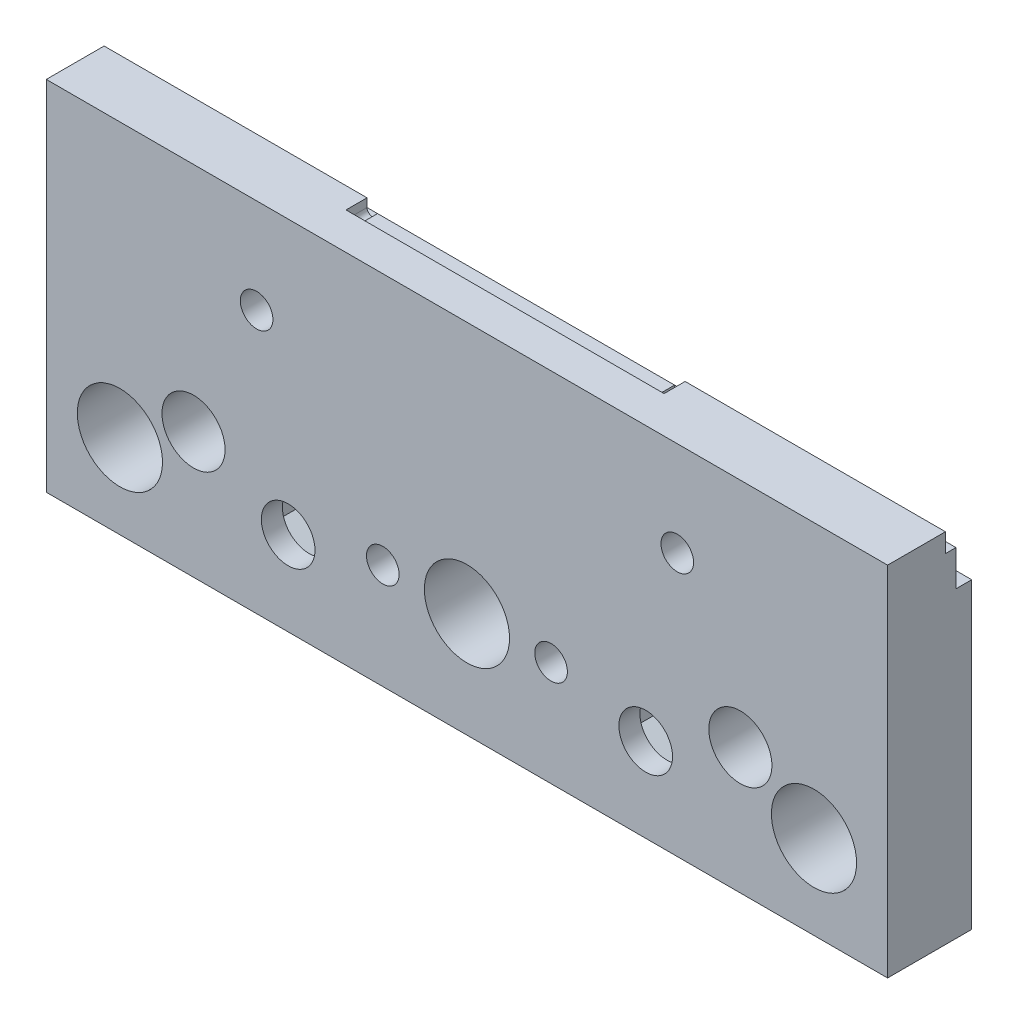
ISO-10303-21;
HEADER;
FILE_DESCRIPTION(('STEP AP214'),'2;1');
FILE_NAME('part.step','',(''),(''),'','','');
FILE_SCHEMA(('AUTOMOTIVE_DESIGN { 1 0 10303 214 1 1 1 1 }'));
ENDSEC;
DATA;
#1=APPLICATION_CONTEXT('core data for automotive mechanical design processes');
#2=APPLICATION_PROTOCOL_DEFINITION('international standard','automotive_design',2000,#1);
#3=PRODUCT_CONTEXT('',#1,'mechanical');
#4=PRODUCT('Part','Part','',(#3));
#5=PRODUCT_RELATED_PRODUCT_CATEGORY('part','',(#4));
#6=PRODUCT_DEFINITION_FORMATION('','',#4);
#7=PRODUCT_DEFINITION_CONTEXT('part definition',#1,'design');
#8=PRODUCT_DEFINITION('design','',#6,#7);
#9=PRODUCT_DEFINITION_SHAPE('','',#8);
#10=(LENGTH_UNIT() NAMED_UNIT(*) SI_UNIT(.MILLI.,.METRE.));
#11=(NAMED_UNIT(*) PLANE_ANGLE_UNIT() SI_UNIT($,.RADIAN.));
#12=(NAMED_UNIT(*) SI_UNIT($,.STERADIAN.) SOLID_ANGLE_UNIT());
#13=UNCERTAINTY_MEASURE_WITH_UNIT(LENGTH_MEASURE(1.E-05),#10,'distance_accuracy_value','');
#14=(GEOMETRIC_REPRESENTATION_CONTEXT(3) GLOBAL_UNCERTAINTY_ASSIGNED_CONTEXT((#13)) GLOBAL_UNIT_ASSIGNED_CONTEXT((#10,
#11,#12)) REPRESENTATION_CONTEXT('',''));
#15=CARTESIAN_POINT('',(0.,0.,0.));
#16=DIRECTION('',(0.,0.,1.));
#17=DIRECTION('',(1.,0.,0.));
#18=AXIS2_PLACEMENT_3D('',#15,#16,#17);
#19=CARTESIAN_POINT('',(57.,8.,0.));
#20=DIRECTION('',(0.,0.,1.));
#21=DIRECTION('',(1.,0.,0.));
#22=AXIS2_PLACEMENT_3D('',#19,#20,#21);
#23=CYLINDRICAL_SURFACE('',#22,2.55);
#24=CARTESIAN_POINT('',(57.,8.,8.));
#25=DIRECTION('',(0.,0.,1.));
#26=DIRECTION('',(1.,0.,0.));
#27=AXIS2_PLACEMENT_3D('',#24,#25,#26);
#28=CIRCLE('',#27,2.55);
#29=CARTESIAN_POINT('',(59.55,8.,8.));
#30=VERTEX_POINT('',#29);
#31=EDGE_CURVE('E582',#30,#30,#28,.T.);
#32=ORIENTED_EDGE('',*,*,#31,.T.);
#33=EDGE_LOOP('',(#32));
#34=FACE_BOUND('',#33,.T.);
#35=CARTESIAN_POINT('',(57.,8.,6.));
#36=DIRECTION('',(0.,0.,-1.));
#37=DIRECTION('',(-1.,0.,0.));
#38=AXIS2_PLACEMENT_3D('',#35,#36,#37);
#39=CIRCLE('',#38,2.55);
#40=CARTESIAN_POINT('',(54.45,8.,6.));
#41=VERTEX_POINT('',#40);
#42=EDGE_CURVE('E37',#41,#41,#39,.F.);
#43=ORIENTED_EDGE('',*,*,#42,.F.);
#44=EDGE_LOOP('',(#43));
#45=FACE_BOUND('',#44,.T.);
#46=ADVANCED_FACE('F33',(#34,#45),#23,.F.);
#47=CARTESIAN_POINT('',(23.,8.,0.));
#48=DIRECTION('',(0.,0.,1.));
#49=DIRECTION('',(1.,0.,0.));
#50=AXIS2_PLACEMENT_3D('',#47,#48,#49);
#51=CYLINDRICAL_SURFACE('',#50,2.55);
#52=CARTESIAN_POINT('',(23.,8.,8.));
#53=DIRECTION('',(0.,0.,1.));
#54=DIRECTION('',(1.,0.,0.));
#55=AXIS2_PLACEMENT_3D('',#52,#53,#54);
#56=CIRCLE('',#55,2.55);
#57=CARTESIAN_POINT('',(25.55,8.,8.));
#58=VERTEX_POINT('',#57);
#59=EDGE_CURVE('E592',#58,#58,#56,.T.);
#60=ORIENTED_EDGE('',*,*,#59,.T.);
#61=EDGE_LOOP('',(#60));
#62=FACE_BOUND('',#61,.T.);
#63=CARTESIAN_POINT('',(23.,8.,6.));
#64=DIRECTION('',(0.,0.,-1.));
#65=DIRECTION('',(-1.,0.,0.));
#66=AXIS2_PLACEMENT_3D('',#63,#64,#65);
#67=CIRCLE('',#66,2.55);
#68=CARTESIAN_POINT('',(20.45,8.,6.));
#69=VERTEX_POINT('',#68);
#70=EDGE_CURVE('E329',#69,#69,#67,.F.);
#71=ORIENTED_EDGE('',*,*,#70,.F.);
#72=EDGE_LOOP('',(#71));
#73=FACE_BOUND('',#72,.T.);
#74=ADVANCED_FACE('F649',(#62,#73),#51,.F.);
#75=CARTESIAN_POINT('',(32.,10.,0.));
#76=DIRECTION('',(0.,0.,1.));
#77=DIRECTION('',(1.,0.,0.));
#78=AXIS2_PLACEMENT_3D('',#75,#76,#77);
#79=CYLINDRICAL_SURFACE('',#78,1.55);
#80=CARTESIAN_POINT('',(32.,10.,8.));
#81=DIRECTION('',(0.,0.,1.));
#82=DIRECTION('',(1.,0.,0.));
#83=AXIS2_PLACEMENT_3D('',#80,#81,#82);
#84=CIRCLE('',#83,1.55);
#85=CARTESIAN_POINT('',(33.55,10.,8.));
#86=VERTEX_POINT('',#85);
#87=EDGE_CURVE('E552',#86,#86,#84,.T.);
#88=ORIENTED_EDGE('',*,*,#87,.T.);
#89=EDGE_LOOP('',(#88));
#90=FACE_BOUND('',#89,.T.);
#91=CARTESIAN_POINT('',(32.,10.,4.5));
#92=DIRECTION('',(0.,0.,-1.));
#93=DIRECTION('',(-1.,0.,0.));
#94=AXIS2_PLACEMENT_3D('',#91,#92,#93);
#95=CIRCLE('',#94,1.55);
#96=CARTESIAN_POINT('',(30.45,10.,4.5));
#97=VERTEX_POINT('',#96);
#98=EDGE_CURVE('E555',#97,#97,#95,.F.);
#99=ORIENTED_EDGE('',*,*,#98,.F.);
#100=EDGE_LOOP('',(#99));
#101=FACE_BOUND('',#100,.T.);
#102=ADVANCED_FACE('F655',(#90,#101),#79,.F.);
#103=CARTESIAN_POINT('',(48.,10.,0.));
#104=DIRECTION('',(0.,0.,1.));
#105=DIRECTION('',(1.,0.,0.));
#106=AXIS2_PLACEMENT_3D('',#103,#104,#105);
#107=CYLINDRICAL_SURFACE('',#106,1.55);
#108=CARTESIAN_POINT('',(48.,10.,8.));
#109=DIRECTION('',(0.,0.,1.));
#110=DIRECTION('',(1.,0.,0.));
#111=AXIS2_PLACEMENT_3D('',#108,#109,#110);
#112=CIRCLE('',#111,1.55);
#113=CARTESIAN_POINT('',(49.55,10.,8.));
#114=VERTEX_POINT('',#113);
#115=EDGE_CURVE('E548',#114,#114,#112,.T.);
#116=ORIENTED_EDGE('',*,*,#115,.T.);
#117=EDGE_LOOP('',(#116));
#118=FACE_BOUND('',#117,.T.);
#119=CARTESIAN_POINT('',(48.,10.,4.5));
#120=DIRECTION('',(0.,0.,-1.));
#121=DIRECTION('',(-1.,0.,0.));
#122=AXIS2_PLACEMENT_3D('',#119,#120,#121);
#123=CIRCLE('',#122,1.55);
#124=CARTESIAN_POINT('',(46.45,10.,4.5));
#125=VERTEX_POINT('',#124);
#126=EDGE_CURVE('E491',#125,#125,#123,.F.);
#127=ORIENTED_EDGE('',*,*,#126,.F.);
#128=EDGE_LOOP('',(#127));
#129=FACE_BOUND('',#128,.T.);
#130=ADVANCED_FACE('F678',(#118,#129),#107,.F.);
#131=CARTESIAN_POINT('',(0.,0.,8.));
#132=DIRECTION('',(0.,0.,1.));
#133=DIRECTION('',(1.,0.,0.));
#134=AXIS2_PLACEMENT_3D('',#131,#132,#133);
#135=PLANE('',#134);
#136=CARTESIAN_POINT('',(66.,11.9999999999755,8.));
#137=DIRECTION('',(0.,0.,-1.));
#138=DIRECTION('',(-1.,0.,0.));
#139=AXIS2_PLACEMENT_3D('',#136,#137,#138);
#140=CIRCLE('',#139,3.00000000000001);
#141=CARTESIAN_POINT('',(63.,11.9999999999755,8.));
#142=VERTEX_POINT('',#141);
#143=EDGE_CURVE('E382',#142,#142,#140,.T.);
#144=ORIENTED_EDGE('',*,*,#143,.T.);
#145=EDGE_LOOP('',(#144));
#146=FACE_BOUND('',#145,.T.);
#147=CARTESIAN_POINT('',(14.,11.9999999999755,8.));
#148=DIRECTION('',(0.,0.,-1.));
#149=DIRECTION('',(1.,0.,0.));
#150=AXIS2_PLACEMENT_3D('',#147,#148,#149);
#151=CIRCLE('',#150,3.);
#152=CARTESIAN_POINT('',(17.,11.9999999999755,8.));
#153=VERTEX_POINT('',#152);
#154=EDGE_CURVE('E389',#153,#153,#151,.T.);
#155=ORIENTED_EDGE('',*,*,#154,.T.);
#156=EDGE_LOOP('',(#155));
#157=FACE_BOUND('',#156,.T.);
#158=CARTESIAN_POINT('',(60.,25.,8.));
#159=DIRECTION('',(0.,0.,-1.));
#160=DIRECTION('',(-1.,0.,0.));
#161=AXIS2_PLACEMENT_3D('',#158,#159,#160);
#162=CIRCLE('',#161,1.55000000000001);
#163=CARTESIAN_POINT('',(58.45,25.,8.));
#164=VERTEX_POINT('',#163);
#165=EDGE_CURVE('E440',#164,#164,#162,.T.);
#166=ORIENTED_EDGE('',*,*,#165,.T.);
#167=EDGE_LOOP('',(#166));
#168=FACE_BOUND('',#167,.T.);
#169=CARTESIAN_POINT('',(20.,25.,8.));
#170=DIRECTION('',(0.,0.,-1.));
#171=DIRECTION('',(-1.,0.,0.));
#172=AXIS2_PLACEMENT_3D('',#169,#170,#171);
#173=CIRCLE('',#172,1.55);
#174=CARTESIAN_POINT('',(18.45,25.,8.));
#175=VERTEX_POINT('',#174);
#176=EDGE_CURVE('E447',#175,#175,#173,.T.);
#177=ORIENTED_EDGE('',*,*,#176,.T.);
#178=EDGE_LOOP('',(#177));
#179=FACE_BOUND('',#178,.T.);
#180=ORIENTED_EDGE('',*,*,#115,.F.);
#181=EDGE_LOOP('',(#180));
#182=FACE_BOUND('',#181,.T.);
#183=ORIENTED_EDGE('',*,*,#87,.F.);
#184=EDGE_LOOP('',(#183));
#185=FACE_BOUND('',#184,.T.);
#186=ORIENTED_EDGE('',*,*,#59,.F.);
#187=EDGE_LOOP('',(#186));
#188=FACE_BOUND('',#187,.T.);
#189=ORIENTED_EDGE('',*,*,#31,.F.);
#190=EDGE_LOOP('',(#189));
#191=FACE_BOUND('',#190,.T.);
#192=CARTESIAN_POINT('',(40.,10.,8.));
#193=DIRECTION('',(0.,0.,1.));
#194=DIRECTION('',(1.,0.,0.));
#195=AXIS2_PLACEMENT_3D('',#192,#193,#194);
#196=CIRCLE('',#195,4.05);
#197=CARTESIAN_POINT('',(44.05,10.,8.));
#198=VERTEX_POINT('',#197);
#199=EDGE_CURVE('E604',#198,#198,#196,.T.);
#200=ORIENTED_EDGE('',*,*,#199,.F.);
#201=EDGE_LOOP('',(#200));
#202=FACE_BOUND('',#201,.T.);
#203=DIRECTION('',(0.,-1.,0.));
#204=VECTOR('',#203,1.);
#205=CARTESIAN_POINT('',(0.,34.,8.));
#206=LINE('',#205,#204);
#207=CARTESIAN_POINT('',(0.,34.,8.));
#208=VERTEX_POINT('',#207);
#209=CARTESIAN_POINT('',(0.,0.,8.));
#210=VERTEX_POINT('',#209);
#211=EDGE_CURVE('E616',#208,#210,#206,.T.);
#212=ORIENTED_EDGE('',*,*,#211,.T.);
#213=DIRECTION('',(1.,0.,0.));
#214=VECTOR('',#213,1.);
#215=CARTESIAN_POINT('',(0.,0.,8.));
#216=LINE('',#215,#214);
#217=CARTESIAN_POINT('',(80.,0.,8.));
#218=VERTEX_POINT('',#217);
#219=EDGE_CURVE('E619',#210,#218,#216,.T.);
#220=ORIENTED_EDGE('',*,*,#219,.T.);
#221=DIRECTION('',(0.,1.,0.));
#222=VECTOR('',#221,1.);
#223=CARTESIAN_POINT('',(80.,0.,8.));
#224=LINE('',#223,#222);
#225=CARTESIAN_POINT('',(80.,34.,8.));
#226=VERTEX_POINT('',#225);
#227=EDGE_CURVE('E622',#218,#226,#224,.T.);
#228=ORIENTED_EDGE('',*,*,#227,.T.);
#229=DIRECTION('',(-1.,0.,0.));
#230=VECTOR('',#229,1.);
#231=CARTESIAN_POINT('',(80.,34.,8.));
#232=LINE('',#231,#230);
#233=EDGE_CURVE('E624',#226,#208,#232,.T.);
#234=ORIENTED_EDGE('',*,*,#233,.T.);
#235=EDGE_LOOP('',(#212,#220,#228,#234));
#236=FACE_BOUND('',#235,.T.);
#237=CARTESIAN_POINT('',(7.,8.,8.));
#238=DIRECTION('',(0.,0.,1.));
#239=DIRECTION('',(1.,0.,0.));
#240=AXIS2_PLACEMENT_3D('',#237,#238,#239);
#241=CIRCLE('',#240,4.05);
#242=CARTESIAN_POINT('',(11.05,8.,8.));
#243=VERTEX_POINT('',#242);
#244=EDGE_CURVE('E610',#243,#243,#241,.T.);
#245=ORIENTED_EDGE('',*,*,#244,.F.);
#246=EDGE_LOOP('',(#245));
#247=FACE_BOUND('',#246,.T.);
#248=CARTESIAN_POINT('',(73.,8.,8.));
#249=DIRECTION('',(0.,0.,1.));
#250=DIRECTION('',(1.,0.,0.));
#251=AXIS2_PLACEMENT_3D('',#248,#249,#250);
#252=CIRCLE('',#251,4.05);
#253=CARTESIAN_POINT('',(77.05,8.,8.));
#254=VERTEX_POINT('',#253);
#255=EDGE_CURVE('E598',#254,#254,#252,.T.);
#256=ORIENTED_EDGE('',*,*,#255,.F.);
#257=EDGE_LOOP('',(#256));
#258=FACE_BOUND('',#257,.T.);
#259=ADVANCED_FACE('F674',(#146,#157,#168,#179,#182,#185,#188,#191,#202,#236,#247,#258),#135,.T.);
#260=CARTESIAN_POINT('',(0.,0.,0.));
#261=DIRECTION('',(0.,0.,1.));
#262=DIRECTION('',(1.,0.,0.));
#263=AXIS2_PLACEMENT_3D('',#260,#261,#262);
#264=PLANE('',#263);
#265=DIRECTION('',(0.,1.,0.));
#266=VECTOR('',#265,1.);
#267=CARTESIAN_POINT('',(52.9,5.63286389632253,0.));
#268=LINE('',#267,#266);
#269=CARTESIAN_POINT('',(52.9,5.63286389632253,0.));
#270=VERTEX_POINT('',#269);
#271=CARTESIAN_POINT('',(52.9,10.3671361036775,0.));
#272=VERTEX_POINT('',#271);
#273=EDGE_CURVE('E316',#270,#272,#268,.T.);
#274=ORIENTED_EDGE('',*,*,#273,.F.);
#275=DIRECTION('',(-0.866025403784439,0.5,0.));
#276=VECTOR('',#275,1.);
#277=CARTESIAN_POINT('',(57.,3.26572779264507,0.));
#278=LINE('',#277,#276);
#279=CARTESIAN_POINT('',(57.,3.26572779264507,0.));
#280=VERTEX_POINT('',#279);
#281=EDGE_CURVE('E50',#280,#270,#278,.T.);
#282=ORIENTED_EDGE('',*,*,#281,.F.);
#283=DIRECTION('',(-0.866025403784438,-0.5,0.));
#284=VECTOR('',#283,1.);
#285=CARTESIAN_POINT('',(61.1,5.63286389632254,0.));
#286=LINE('',#285,#284);
#287=CARTESIAN_POINT('',(61.1,5.63286389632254,0.));
#288=VERTEX_POINT('',#287);
#289=EDGE_CURVE('E302',#288,#280,#286,.T.);
#290=ORIENTED_EDGE('',*,*,#289,.F.);
#291=DIRECTION('',(0.,-1.,0.));
#292=VECTOR('',#291,1.);
#293=CARTESIAN_POINT('',(61.1,10.3671361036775,0.));
#294=LINE('',#293,#292);
#295=CARTESIAN_POINT('',(61.1,10.3671361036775,0.));
#296=VERTEX_POINT('',#295);
#297=EDGE_CURVE('E305',#296,#288,#294,.T.);
#298=ORIENTED_EDGE('',*,*,#297,.F.);
#299=DIRECTION('',(0.866025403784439,-0.5,0.));
#300=VECTOR('',#299,1.);
#301=CARTESIAN_POINT('',(57.,12.7342722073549,0.));
#302=LINE('',#301,#300);
#303=CARTESIAN_POINT('',(57.,12.7342722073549,0.));
#304=VERTEX_POINT('',#303);
#305=EDGE_CURVE('E322',#304,#296,#302,.T.);
#306=ORIENTED_EDGE('',*,*,#305,.F.);
#307=DIRECTION('',(0.866025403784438,0.5,0.));
#308=VECTOR('',#307,1.);
#309=CARTESIAN_POINT('',(52.9,10.3671361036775,0.));
#310=LINE('',#309,#308);
#311=EDGE_CURVE('E319',#272,#304,#310,.T.);
#312=ORIENTED_EDGE('',*,*,#311,.F.);
#313=EDGE_LOOP('',(#274,#282,#290,#298,#306,#312));
#314=FACE_BOUND('',#313,.T.);
#315=DIRECTION('',(-0.866025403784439,0.499999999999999,0.));
#316=VECTOR('',#315,1.);
#317=CARTESIAN_POINT('',(23.,3.26572779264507,0.));
#318=LINE('',#317,#316);
#319=CARTESIAN_POINT('',(23.,3.26572779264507,0.));
#320=VERTEX_POINT('',#319);
#321=CARTESIAN_POINT('',(18.9,5.63286389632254,0.));
#322=VERTEX_POINT('',#321);
#323=EDGE_CURVE('E358',#320,#322,#318,.T.);
#324=ORIENTED_EDGE('',*,*,#323,.F.);
#325=DIRECTION('',(-0.866025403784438,-0.500000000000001,0.));
#326=VECTOR('',#325,1.);
#327=CARTESIAN_POINT('',(27.1,5.63286389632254,0.));
#328=LINE('',#327,#326);
#329=CARTESIAN_POINT('',(27.1,5.63286389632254,0.));
#330=VERTEX_POINT('',#329);
#331=EDGE_CURVE('E58',#330,#320,#328,.T.);
#332=ORIENTED_EDGE('',*,*,#331,.F.);
#333=DIRECTION('',(0.,-1.,0.));
#334=VECTOR('',#333,1.);
#335=CARTESIAN_POINT('',(27.1,10.3671361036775,0.));
#336=LINE('',#335,#334);
#337=CARTESIAN_POINT('',(27.1,10.3671361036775,0.));
#338=VERTEX_POINT('',#337);
#339=EDGE_CURVE('E341',#338,#330,#336,.T.);
#340=ORIENTED_EDGE('',*,*,#339,.F.);
#341=DIRECTION('',(0.866025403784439,-0.5,0.));
#342=VECTOR('',#341,1.);
#343=CARTESIAN_POINT('',(23.,12.7342722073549,0.));
#344=LINE('',#343,#342);
#345=CARTESIAN_POINT('',(23.,12.7342722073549,0.));
#346=VERTEX_POINT('',#345);
#347=EDGE_CURVE('E367',#346,#338,#344,.T.);
#348=ORIENTED_EDGE('',*,*,#347,.F.);
#349=DIRECTION('',(0.866025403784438,0.5,0.));
#350=VECTOR('',#349,1.);
#351=CARTESIAN_POINT('',(18.9,10.3671361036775,0.));
#352=LINE('',#351,#350);
#353=CARTESIAN_POINT('',(18.9,10.3671361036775,0.));
#354=VERTEX_POINT('',#353);
#355=EDGE_CURVE('E364',#354,#346,#352,.T.);
#356=ORIENTED_EDGE('',*,*,#355,.F.);
#357=DIRECTION('',(0.,1.,0.));
#358=VECTOR('',#357,1.);
#359=CARTESIAN_POINT('',(18.9,5.63286389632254,0.));
#360=LINE('',#359,#358);
#361=EDGE_CURVE('E361',#322,#354,#360,.T.);
#362=ORIENTED_EDGE('',*,*,#361,.F.);
#363=EDGE_LOOP('',(#324,#332,#340,#348,#356,#362));
#364=FACE_BOUND('',#363,.T.);
#365=CARTESIAN_POINT('',(66.,11.9999999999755,0.));
#366=DIRECTION('',(0.,0.,-1.));
#367=DIRECTION('',(-1.,0.,0.));
#368=AXIS2_PLACEMENT_3D('',#365,#366,#367);
#369=CIRCLE('',#368,3.00000000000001);
#370=CARTESIAN_POINT('',(63.,11.9999999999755,0.));
#371=VERTEX_POINT('',#370);
#372=EDGE_CURVE('E386',#371,#371,#369,.T.);
#373=ORIENTED_EDGE('',*,*,#372,.F.);
#374=EDGE_LOOP('',(#373));
#375=FACE_BOUND('',#374,.T.);
#376=CARTESIAN_POINT('',(14.,11.9999999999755,0.));
#377=DIRECTION('',(0.,0.,-1.));
#378=DIRECTION('',(1.,0.,0.));
#379=AXIS2_PLACEMENT_3D('',#376,#377,#378);
#380=CIRCLE('',#379,3.);
#381=CARTESIAN_POINT('',(17.,11.9999999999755,0.));
#382=VERTEX_POINT('',#381);
#383=EDGE_CURVE('E392',#382,#382,#380,.T.);
#384=ORIENTED_EDGE('',*,*,#383,.F.);
#385=EDGE_LOOP('',(#384));
#386=FACE_BOUND('',#385,.T.);
#387=CARTESIAN_POINT('',(60.,25.,0.));
#388=DIRECTION('',(0.,0.,-1.));
#389=DIRECTION('',(-1.,0.,0.));
#390=AXIS2_PLACEMENT_3D('',#387,#388,#389);
#391=CIRCLE('',#390,1.55000000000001);
#392=CARTESIAN_POINT('',(58.45,25.,0.));
#393=VERTEX_POINT('',#392);
#394=EDGE_CURVE('E444',#393,#393,#391,.T.);
#395=ORIENTED_EDGE('',*,*,#394,.F.);
#396=EDGE_LOOP('',(#395));
#397=FACE_BOUND('',#396,.T.);
#398=CARTESIAN_POINT('',(20.,25.,0.));
#399=DIRECTION('',(0.,0.,-1.));
#400=DIRECTION('',(-1.,0.,0.));
#401=AXIS2_PLACEMENT_3D('',#398,#399,#400);
#402=CIRCLE('',#401,1.55);
#403=CARTESIAN_POINT('',(18.45,25.,0.));
#404=VERTEX_POINT('',#403);
#405=EDGE_CURVE('E429',#404,#404,#402,.T.);
#406=ORIENTED_EDGE('',*,*,#405,.F.);
#407=EDGE_LOOP('',(#406));
#408=FACE_BOUND('',#407,.T.);
#409=DIRECTION('',(0.,-1.,0.));
#410=VECTOR('',#409,1.);
#411=CARTESIAN_POINT('',(50.85,11.6454482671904,0.));
#412=LINE('',#411,#410);
#413=CARTESIAN_POINT('',(50.85,11.6454482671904,0.));
#414=VERTEX_POINT('',#413);
#415=CARTESIAN_POINT('',(50.85,8.35455173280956,0.));
#416=VERTEX_POINT('',#415);
#417=EDGE_CURVE('E474',#414,#416,#412,.T.);
#418=ORIENTED_EDGE('',*,*,#417,.F.);
#419=DIRECTION('',(0.866025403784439,-0.499999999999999,0.));
#420=VECTOR('',#419,1.);
#421=CARTESIAN_POINT('',(48.,13.2908965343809,0.));
#422=LINE('',#421,#420);
#423=CARTESIAN_POINT('',(48.,13.2908965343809,0.));
#424=VERTEX_POINT('',#423);
#425=EDGE_CURVE('E472',#424,#414,#422,.T.);
#426=ORIENTED_EDGE('',*,*,#425,.F.);
#427=DIRECTION('',(0.866025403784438,0.500000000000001,0.));
#428=VECTOR('',#427,1.);
#429=CARTESIAN_POINT('',(45.15,11.6454482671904,0.));
#430=LINE('',#429,#428);
#431=CARTESIAN_POINT('',(45.15,11.6454482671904,0.));
#432=VERTEX_POINT('',#431);
#433=EDGE_CURVE('E456',#432,#424,#430,.T.);
#434=ORIENTED_EDGE('',*,*,#433,.F.);
#435=DIRECTION('',(0.,1.,0.));
#436=VECTOR('',#435,1.);
#437=CARTESIAN_POINT('',(45.15,8.35455173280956,0.));
#438=LINE('',#437,#436);
#439=CARTESIAN_POINT('',(45.15,8.35455173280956,0.));
#440=VERTEX_POINT('',#439);
#441=EDGE_CURVE('E484',#440,#432,#438,.T.);
#442=ORIENTED_EDGE('',*,*,#441,.F.);
#443=DIRECTION('',(-0.866025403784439,0.499999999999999,0.));
#444=VECTOR('',#443,1.);
#445=CARTESIAN_POINT('',(48.,6.70910346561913,0.));
#446=LINE('',#445,#444);
#447=CARTESIAN_POINT('',(48.,6.70910346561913,0.));
#448=VERTEX_POINT('',#447);
#449=EDGE_CURVE('E481',#448,#440,#446,.T.);
#450=ORIENTED_EDGE('',*,*,#449,.F.);
#451=DIRECTION('',(-0.866025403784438,-0.5,0.));
#452=VECTOR('',#451,1.);
#453=CARTESIAN_POINT('',(50.85,8.35455173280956,0.));
#454=LINE('',#453,#452);
#455=EDGE_CURVE('E478',#416,#448,#454,.T.);
#456=ORIENTED_EDGE('',*,*,#455,.F.);
#457=EDGE_LOOP('',(#418,#426,#434,#442,#450,#456));
#458=FACE_BOUND('',#457,.T.);
#459=DIRECTION('',(-0.866025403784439,-0.499999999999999,0.));
#460=VECTOR('',#459,1.);
#461=CARTESIAN_POINT('',(34.85,8.35455173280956,0.));
#462=LINE('',#461,#460);
#463=CARTESIAN_POINT('',(34.85,8.35455173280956,0.));
#464=VERTEX_POINT('',#463);
#465=CARTESIAN_POINT('',(32.,6.70910346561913,0.));
#466=VERTEX_POINT('',#465);
#467=EDGE_CURVE('E528',#464,#466,#462,.T.);
#468=ORIENTED_EDGE('',*,*,#467,.F.);
#469=DIRECTION('',(0.,-1.,0.));
#470=VECTOR('',#469,1.);
#471=CARTESIAN_POINT('',(34.85,11.6454482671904,0.));
#472=LINE('',#471,#470);
#473=CARTESIAN_POINT('',(34.85,11.6454482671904,0.));
#474=VERTEX_POINT('',#473);
#475=EDGE_CURVE('E475',#474,#464,#472,.T.);
#476=ORIENTED_EDGE('',*,*,#475,.F.);
#477=DIRECTION('',(0.866025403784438,-0.500000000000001,0.));
#478=VECTOR('',#477,1.);
#479=CARTESIAN_POINT('',(32.,13.2908965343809,0.));
#480=LINE('',#479,#478);
#481=CARTESIAN_POINT('',(32.,13.2908965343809,0.));
#482=VERTEX_POINT('',#481);
#483=EDGE_CURVE('E515',#482,#474,#480,.T.);
#484=ORIENTED_EDGE('',*,*,#483,.F.);
#485=DIRECTION('',(0.866025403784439,0.499999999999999,0.));
#486=VECTOR('',#485,1.);
#487=CARTESIAN_POINT('',(29.15,11.6454482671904,0.));
#488=LINE('',#487,#486);
#489=CARTESIAN_POINT('',(29.15,11.6454482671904,0.));
#490=VERTEX_POINT('',#489);
#491=EDGE_CURVE('E518',#490,#482,#488,.T.);
#492=ORIENTED_EDGE('',*,*,#491,.F.);
#493=DIRECTION('',(0.,1.,0.));
#494=VECTOR('',#493,1.);
#495=CARTESIAN_POINT('',(29.15,8.35455173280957,0.));
#496=LINE('',#495,#494);
#497=CARTESIAN_POINT('',(29.15,8.35455173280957,0.));
#498=VERTEX_POINT('',#497);
#499=EDGE_CURVE('E522',#498,#490,#496,.T.);
#500=ORIENTED_EDGE('',*,*,#499,.F.);
#501=DIRECTION('',(-0.866025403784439,0.5,0.));
#502=VECTOR('',#501,1.);
#503=CARTESIAN_POINT('',(32.,6.70910346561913,0.));
#504=LINE('',#503,#502);
#505=EDGE_CURVE('E525',#466,#498,#504,.T.);
#506=ORIENTED_EDGE('',*,*,#505,.F.);
#507=EDGE_LOOP('',(#468,#476,#484,#492,#500,#506));
#508=FACE_BOUND('',#507,.T.);
#509=DIRECTION('',(0.,-1.,0.));
#510=VECTOR('',#509,1.);
#511=CARTESIAN_POINT('',(0.,34.,0.));
#512=LINE('',#511,#510);
#513=CARTESIAN_POINT('',(0.,28.7999999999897,0.));
#514=VERTEX_POINT('',#513);
#515=CARTESIAN_POINT('',(0.,0.,0.));
#516=VERTEX_POINT('',#515);
#517=EDGE_CURVE('E613',#514,#516,#512,.T.);
#518=ORIENTED_EDGE('',*,*,#517,.F.);
#519=DIRECTION('',(1.,0.,0.));
#520=VECTOR('',#519,1.);
#521=CARTESIAN_POINT('',(0.,28.7999999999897,0.));
#522=LINE('',#521,#520);
#523=CARTESIAN_POINT('',(80.,28.7999999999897,0.));
#524=VERTEX_POINT('',#523);
#525=EDGE_CURVE('E579',#514,#524,#522,.T.);
#526=ORIENTED_EDGE('',*,*,#525,.T.);
#527=DIRECTION('',(0.,1.,0.));
#528=VECTOR('',#527,1.);
#529=CARTESIAN_POINT('',(80.,0.,0.));
#530=LINE('',#529,#528);
#531=CARTESIAN_POINT('',(80.,0.,0.));
#532=VERTEX_POINT('',#531);
#533=EDGE_CURVE('E620',#532,#524,#530,.T.);
#534=ORIENTED_EDGE('',*,*,#533,.F.);
#535=DIRECTION('',(1.,0.,0.));
#536=VECTOR('',#535,1.);
#537=CARTESIAN_POINT('',(0.,0.,0.));
#538=LINE('',#537,#536);
#539=EDGE_CURVE('E628',#516,#532,#538,.T.);
#540=ORIENTED_EDGE('',*,*,#539,.F.);
#541=EDGE_LOOP('',(#518,#526,#534,#540));
#542=FACE_BOUND('',#541,.T.);
#543=CARTESIAN_POINT('',(7.,8.,0.));
#544=DIRECTION('',(0.,0.,1.));
#545=DIRECTION('',(1.,0.,0.));
#546=AXIS2_PLACEMENT_3D('',#543,#544,#545);
#547=CIRCLE('',#546,4.05);
#548=CARTESIAN_POINT('',(11.05,8.,0.));
#549=VERTEX_POINT('',#548);
#550=EDGE_CURVE('E607',#549,#549,#547,.T.);
#551=ORIENTED_EDGE('',*,*,#550,.T.);
#552=EDGE_LOOP('',(#551));
#553=FACE_BOUND('',#552,.T.);
#554=CARTESIAN_POINT('',(40.,10.,0.));
#555=DIRECTION('',(0.,0.,1.));
#556=DIRECTION('',(1.,0.,0.));
#557=AXIS2_PLACEMENT_3D('',#554,#555,#556);
#558=CIRCLE('',#557,4.05);
#559=CARTESIAN_POINT('',(44.05,10.,0.));
#560=VERTEX_POINT('',#559);
#561=EDGE_CURVE('E601',#560,#560,#558,.T.);
#562=ORIENTED_EDGE('',*,*,#561,.T.);
#563=EDGE_LOOP('',(#562));
#564=FACE_BOUND('',#563,.T.);
#565=CARTESIAN_POINT('',(73.,8.,0.));
#566=DIRECTION('',(0.,0.,1.));
#567=DIRECTION('',(1.,0.,0.));
#568=AXIS2_PLACEMENT_3D('',#565,#566,#567);
#569=CIRCLE('',#568,4.05);
#570=CARTESIAN_POINT('',(77.05,8.,0.));
#571=VERTEX_POINT('',#570);
#572=EDGE_CURVE('E595',#571,#571,#569,.T.);
#573=ORIENTED_EDGE('',*,*,#572,.T.);
#574=EDGE_LOOP('',(#573));
#575=FACE_BOUND('',#574,.T.);
#576=ADVANCED_FACE('F677',(#314,#364,#375,#386,#397,#408,#458,#508,#542,#553,#564,#575),#264,.F.);
#577=CARTESIAN_POINT('',(0.,34.,8.));
#578=DIRECTION('',(1.,0.,0.));
#579=DIRECTION('',(0.,0.,-1.));
#580=AXIS2_PLACEMENT_3D('',#577,#578,#579);
#581=PLANE('',#580);
#582=DIRECTION('',(0.,-1.,0.));
#583=VECTOR('',#582,1.);
#584=CARTESIAN_POINT('',(0.,32.2,1.5));
#585=LINE('',#584,#583);
#586=CARTESIAN_POINT('',(0.,32.2,1.5));
#587=VERTEX_POINT('',#586);
#588=CARTESIAN_POINT('',(0.,28.8,1.5));
#589=VERTEX_POINT('',#588);
#590=EDGE_CURVE('E563',#587,#589,#585,.T.);
#591=ORIENTED_EDGE('',*,*,#590,.T.);
#592=DIRECTION('',(0.,-6.85562717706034E-12,-1.));
#593=VECTOR('',#592,1.);
#594=CARTESIAN_POINT('',(0.,28.8,1.5));
#595=LINE('',#594,#593);
#596=EDGE_CURVE('E566',#589,#514,#595,.T.);
#597=ORIENTED_EDGE('',*,*,#596,.T.);
#598=ORIENTED_EDGE('',*,*,#517,.T.);
#599=DIRECTION('',(0.,0.,-1.));
#600=VECTOR('',#599,1.);
#601=CARTESIAN_POINT('',(0.,0.,8.));
#602=LINE('',#601,#600);
#603=EDGE_CURVE('E11',#210,#516,#602,.T.);
#604=ORIENTED_EDGE('',*,*,#603,.F.);
#605=ORIENTED_EDGE('',*,*,#211,.F.);
#606=DIRECTION('',(0.,0.,-1.));
#607=VECTOR('',#606,1.);
#608=CARTESIAN_POINT('',(0.,34.,8.));
#609=LINE('',#608,#607);
#610=CARTESIAN_POINT('',(0.,34.,2.5));
#611=VERTEX_POINT('',#610);
#612=EDGE_CURVE('E626',#208,#611,#609,.T.);
#613=ORIENTED_EDGE('',*,*,#612,.T.);
#614=DIRECTION('',(0.,-1.,0.));
#615=VECTOR('',#614,1.);
#616=CARTESIAN_POINT('',(0.,32.2,2.5));
#617=LINE('',#616,#615);
#618=CARTESIAN_POINT('',(0.,32.2,2.5));
#619=VERTEX_POINT('',#618);
#620=EDGE_CURVE('E556',#611,#619,#617,.T.);
#621=ORIENTED_EDGE('',*,*,#620,.T.);
#622=DIRECTION('',(0.,0.,-1.));
#623=VECTOR('',#622,1.);
#624=CARTESIAN_POINT('',(0.,32.2,1.5));
#625=LINE('',#624,#623);
#626=EDGE_CURVE('E559',#619,#587,#625,.T.);
#627=ORIENTED_EDGE('',*,*,#626,.T.);
#628=EDGE_LOOP('',(#591,#597,#598,#604,#605,#613,#621,#627));
#629=FACE_BOUND('',#628,.T.);
#630=ADVANCED_FACE('F35',(#629),#581,.F.);
#631=CARTESIAN_POINT('',(0.,0.,8.));
#632=DIRECTION('',(0.,1.,0.));
#633=DIRECTION('',(0.,0.,1.));
#634=AXIS2_PLACEMENT_3D('',#631,#632,#633);
#635=PLANE('',#634);
#636=ORIENTED_EDGE('',*,*,#539,.T.);
#637=DIRECTION('',(0.,0.,-1.));
#638=VECTOR('',#637,1.);
#639=CARTESIAN_POINT('',(80.,0.,8.));
#640=LINE('',#639,#638);
#641=EDGE_CURVE('E42',#218,#532,#640,.T.);
#642=ORIENTED_EDGE('',*,*,#641,.F.);
#643=ORIENTED_EDGE('',*,*,#219,.F.);
#644=ORIENTED_EDGE('',*,*,#603,.T.);
#645=EDGE_LOOP('',(#636,#642,#643,#644));
#646=FACE_BOUND('',#645,.T.);
#647=ADVANCED_FACE('F688',(#646),#635,.F.);
#648=CARTESIAN_POINT('',(80.,0.,8.));
#649=DIRECTION('',(-1.,0.,0.));
#650=DIRECTION('',(0.,0.,1.));
#651=AXIS2_PLACEMENT_3D('',#648,#649,#650);
#652=PLANE('',#651);
#653=ORIENTED_EDGE('',*,*,#533,.T.);
#654=DIRECTION('',(0.,-6.85562717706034E-12,-1.));
#655=VECTOR('',#654,1.);
#656=CARTESIAN_POINT('',(80.,28.8,1.5));
#657=LINE('',#656,#655);
#658=CARTESIAN_POINT('',(80.,28.8,1.5));
#659=VERTEX_POINT('',#658);
#660=EDGE_CURVE('E560',#659,#524,#657,.T.);
#661=ORIENTED_EDGE('',*,*,#660,.F.);
#662=DIRECTION('',(0.,-1.,0.));
#663=VECTOR('',#662,1.);
#664=CARTESIAN_POINT('',(80.,32.2,1.5));
#665=LINE('',#664,#663);
#666=CARTESIAN_POINT('',(80.,32.2,1.5));
#667=VERTEX_POINT('',#666);
#668=EDGE_CURVE('E575',#667,#659,#665,.T.);
#669=ORIENTED_EDGE('',*,*,#668,.F.);
#670=DIRECTION('',(0.,0.,-1.));
#671=VECTOR('',#670,1.);
#672=CARTESIAN_POINT('',(80.,32.2,1.5));
#673=LINE('',#672,#671);
#674=CARTESIAN_POINT('',(80.,32.2,2.5));
#675=VERTEX_POINT('',#674);
#676=EDGE_CURVE('E572',#675,#667,#673,.T.);
#677=ORIENTED_EDGE('',*,*,#676,.F.);
#678=DIRECTION('',(0.,-1.,0.));
#679=VECTOR('',#678,1.);
#680=CARTESIAN_POINT('',(80.,32.2,2.5));
#681=LINE('',#680,#679);
#682=CARTESIAN_POINT('',(80.,34.,2.5));
#683=VERTEX_POINT('',#682);
#684=EDGE_CURVE('E551',#683,#675,#681,.T.);
#685=ORIENTED_EDGE('',*,*,#684,.F.);
#686=DIRECTION('',(0.,0.,-1.));
#687=VECTOR('',#686,1.);
#688=CARTESIAN_POINT('',(80.,34.,8.));
#689=LINE('',#688,#687);
#690=EDGE_CURVE('E634',#226,#683,#689,.T.);
#691=ORIENTED_EDGE('',*,*,#690,.F.);
#692=ORIENTED_EDGE('',*,*,#227,.F.);
#693=ORIENTED_EDGE('',*,*,#641,.T.);
#694=EDGE_LOOP('',(#653,#661,#669,#677,#685,#691,#692,#693));
#695=FACE_BOUND('',#694,.T.);
#696=ADVANCED_FACE('F685',(#695),#652,.F.);
#697=CARTESIAN_POINT('',(80.,34.,8.));
#698=DIRECTION('',(0.,-1.,0.));
#699=DIRECTION('',(1.,0.,0.));
#700=AXIS2_PLACEMENT_3D('',#697,#698,#699);
#701=PLANE('',#700);
#702=DIRECTION('',(1.,0.,0.));
#703=VECTOR('',#702,1.);
#704=CARTESIAN_POINT('',(25.000000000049,34.,4.49999999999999));
#705=LINE('',#704,#703);
#706=CARTESIAN_POINT('',(25.000000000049,34.,4.49999999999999));
#707=VERTEX_POINT('',#706);
#708=CARTESIAN_POINT('',(55.247938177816,34.,4.49999999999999));
#709=VERTEX_POINT('',#708);
#710=EDGE_CURVE('E398',#707,#709,#705,.T.);
#711=ORIENTED_EDGE('',*,*,#710,.F.);
#712=DIRECTION('',(0.,0.,-1.));
#713=VECTOR('',#712,1.);
#714=CARTESIAN_POINT('',(25.000000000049,34.,4.49999999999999));
#715=LINE('',#714,#713);
#716=CARTESIAN_POINT('',(25.000000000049,34.,2.49999999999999));
#717=VERTEX_POINT('',#716);
#718=EDGE_CURVE('E414',#707,#717,#715,.T.);
#719=ORIENTED_EDGE('',*,*,#718,.T.);
#720=DIRECTION('',(1.,0.,0.));
#721=VECTOR('',#720,1.);
#722=CARTESIAN_POINT('',(0.,34.,2.5));
#723=LINE('',#722,#721);
#724=EDGE_CURVE('E589',#611,#717,#723,.T.);
#725=ORIENTED_EDGE('',*,*,#724,.F.);
#726=ORIENTED_EDGE('',*,*,#612,.F.);
#727=ORIENTED_EDGE('',*,*,#233,.F.);
#728=ORIENTED_EDGE('',*,*,#690,.T.);
#729=CARTESIAN_POINT('',(55.247938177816,34.,2.5));
#730=VERTEX_POINT('',#729);
#731=EDGE_CURVE('E569',#730,#683,#723,.T.);
#732=ORIENTED_EDGE('',*,*,#731,.F.);
#733=DIRECTION('',(0.,0.,-1.));
#734=VECTOR('',#733,1.);
#735=CARTESIAN_POINT('',(55.247938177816,34.,4.49999999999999));
#736=LINE('',#735,#734);
#737=EDGE_CURVE('E436',#709,#730,#736,.T.);
#738=ORIENTED_EDGE('',*,*,#737,.F.);
#739=EDGE_LOOP('',(#711,#719,#725,#726,#727,#728,#732,#738));
#740=FACE_BOUND('',#739,.T.);
#741=ADVANCED_FACE('F672',(#740),#701,.F.);
#742=CARTESIAN_POINT('',(7.,8.,8.));
#743=DIRECTION('',(0.,0.,-1.));
#744=DIRECTION('',(-1.,0.,0.));
#745=AXIS2_PLACEMENT_3D('',#742,#743,#744);
#746=CYLINDRICAL_SURFACE('',#745,4.05);
#747=ORIENTED_EDGE('',*,*,#244,.T.);
#748=EDGE_LOOP('',(#747));
#749=FACE_BOUND('',#748,.T.);
#750=ORIENTED_EDGE('',*,*,#550,.F.);
#751=EDGE_LOOP('',(#750));
#752=FACE_BOUND('',#751,.T.);
#753=ADVANCED_FACE('F668',(#749,#752),#746,.F.);
#754=CARTESIAN_POINT('',(40.,10.,8.));
#755=DIRECTION('',(0.,0.,-1.));
#756=DIRECTION('',(-1.,0.,0.));
#757=AXIS2_PLACEMENT_3D('',#754,#755,#756);
#758=CYLINDRICAL_SURFACE('',#757,4.05);
#759=ORIENTED_EDGE('',*,*,#199,.T.);
#760=EDGE_LOOP('',(#759));
#761=FACE_BOUND('',#760,.T.);
#762=ORIENTED_EDGE('',*,*,#561,.F.);
#763=EDGE_LOOP('',(#762));
#764=FACE_BOUND('',#763,.T.);
#765=ADVANCED_FACE('F664',(#761,#764),#758,.F.);
#766=CARTESIAN_POINT('',(73.,8.,8.));
#767=DIRECTION('',(0.,0.,-1.));
#768=DIRECTION('',(-1.,0.,0.));
#769=AXIS2_PLACEMENT_3D('',#766,#767,#768);
#770=CYLINDRICAL_SURFACE('',#769,4.05);
#771=ORIENTED_EDGE('',*,*,#255,.T.);
#772=EDGE_LOOP('',(#771));
#773=FACE_BOUND('',#772,.T.);
#774=ORIENTED_EDGE('',*,*,#572,.F.);
#775=EDGE_LOOP('',(#774));
#776=FACE_BOUND('',#775,.T.);
#777=ADVANCED_FACE('F660',(#773,#776),#770,.F.);
#778=CARTESIAN_POINT('',(0.,28.8,1.5));
#779=DIRECTION('',(0.,-1.,6.85562717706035E-12));
#780=DIRECTION('',(0.,-6.85562717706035E-12,-1.));
#781=AXIS2_PLACEMENT_3D('',#778,#779,#780);
#782=PLANE('',#781);
#783=ORIENTED_EDGE('',*,*,#660,.T.);
#784=ORIENTED_EDGE('',*,*,#525,.F.);
#785=ORIENTED_EDGE('',*,*,#596,.F.);
#786=DIRECTION('',(1.,0.,0.));
#787=VECTOR('',#786,1.);
#788=CARTESIAN_POINT('',(0.,28.8,1.5));
#789=LINE('',#788,#787);
#790=EDGE_CURVE('E583',#589,#659,#789,.T.);
#791=ORIENTED_EDGE('',*,*,#790,.T.);
#792=EDGE_LOOP('',(#783,#784,#785,#791));
#793=FACE_BOUND('',#792,.T.);
#794=ADVANCED_FACE('F663',(#793),#782,.F.);
#795=CARTESIAN_POINT('',(0.,32.2,1.5));
#796=DIRECTION('',(0.,0.,1.));
#797=DIRECTION('',(0.,-1.,0.));
#798=AXIS2_PLACEMENT_3D('',#795,#796,#797);
#799=PLANE('',#798);
#800=ORIENTED_EDGE('',*,*,#668,.T.);
#801=ORIENTED_EDGE('',*,*,#790,.F.);
#802=ORIENTED_EDGE('',*,*,#590,.F.);
#803=DIRECTION('',(1.,0.,0.));
#804=VECTOR('',#803,1.);
#805=CARTESIAN_POINT('',(0.,32.2,1.5));
#806=LINE('',#805,#804);
#807=EDGE_CURVE('E585',#587,#667,#806,.T.);
#808=ORIENTED_EDGE('',*,*,#807,.T.);
#809=EDGE_LOOP('',(#800,#801,#802,#808));
#810=FACE_BOUND('',#809,.T.);
#811=ADVANCED_FACE('F711',(#810),#799,.F.);
#812=CARTESIAN_POINT('',(0.,32.2,1.5));
#813=DIRECTION('',(0.,-1.,0.));
#814=DIRECTION('',(0.,0.,-1.));
#815=AXIS2_PLACEMENT_3D('',#812,#813,#814);
#816=PLANE('',#815);
#817=ORIENTED_EDGE('',*,*,#676,.T.);
#818=ORIENTED_EDGE('',*,*,#807,.F.);
#819=ORIENTED_EDGE('',*,*,#626,.F.);
#820=DIRECTION('',(1.,0.,0.));
#821=VECTOR('',#820,1.);
#822=CARTESIAN_POINT('',(0.,32.2,2.5));
#823=LINE('',#822,#821);
#824=EDGE_CURVE('E587',#619,#675,#823,.T.);
#825=ORIENTED_EDGE('',*,*,#824,.T.);
#826=EDGE_LOOP('',(#817,#818,#819,#825));
#827=FACE_BOUND('',#826,.T.);
#828=ADVANCED_FACE('F716',(#827),#816,.F.);
#829=CARTESIAN_POINT('',(0.,32.2,2.5));
#830=DIRECTION('',(0.,0.,1.));
#831=DIRECTION('',(0.,-1.,0.));
#832=AXIS2_PLACEMENT_3D('',#829,#830,#831);
#833=PLANE('',#832);
#834=ORIENTED_EDGE('',*,*,#724,.T.);
#835=DIRECTION('',(0.,1.,0.));
#836=VECTOR('',#835,1.);
#837=CARTESIAN_POINT('',(25.000000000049,34.,2.49999999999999));
#838=LINE('',#837,#836);
#839=CARTESIAN_POINT('',(25.000000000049,33.2,2.49999999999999));
#840=VERTEX_POINT('',#839);
#841=EDGE_CURVE('E385',#840,#717,#838,.T.);
#842=ORIENTED_EDGE('',*,*,#841,.F.);
#843=CARTESIAN_POINT('',(25.500000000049,33.2,2.49999999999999));
#844=DIRECTION('',(0.,0.,-1.));
#845=DIRECTION('',(-1.,0.,0.));
#846=AXIS2_PLACEMENT_3D('',#843,#844,#845);
#847=CIRCLE('',#846,0.500000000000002);
#848=CARTESIAN_POINT('',(26.000000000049,33.2,2.49999999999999));
#849=VERTEX_POINT('',#848);
#850=EDGE_CURVE('E399',#849,#840,#847,.T.);
#851=ORIENTED_EDGE('',*,*,#850,.F.);
#852=DIRECTION('',(-1.,0.,0.));
#853=VECTOR('',#852,1.);
#854=CARTESIAN_POINT('',(26.000000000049,33.2,2.49999999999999));
#855=LINE('',#854,#853);
#856=CARTESIAN_POINT('',(54.247938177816,33.2,2.49999999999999));
#857=VERTEX_POINT('',#856);
#858=EDGE_CURVE('E422',#857,#849,#855,.T.);
#859=ORIENTED_EDGE('',*,*,#858,.F.);
#860=CARTESIAN_POINT('',(54.747938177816,33.2,2.49999999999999));
#861=DIRECTION('',(0.,0.,-1.));
#862=DIRECTION('',(-1.,0.,0.));
#863=AXIS2_PLACEMENT_3D('',#860,#861,#862);
#864=CIRCLE('',#863,0.5);
#865=CARTESIAN_POINT('',(55.247938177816,33.2,2.49999999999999));
#866=VERTEX_POINT('',#865);
#867=EDGE_CURVE('E419',#866,#857,#864,.T.);
#868=ORIENTED_EDGE('',*,*,#867,.F.);
#869=DIRECTION('',(0.,-1.,0.));
#870=VECTOR('',#869,1.);
#871=CARTESIAN_POINT('',(55.247938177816,34.,2.49999999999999));
#872=LINE('',#871,#870);
#873=EDGE_CURVE('E416',#730,#866,#872,.T.);
#874=ORIENTED_EDGE('',*,*,#873,.F.);
#875=ORIENTED_EDGE('',*,*,#731,.T.);
#876=ORIENTED_EDGE('',*,*,#684,.T.);
#877=ORIENTED_EDGE('',*,*,#824,.F.);
#878=ORIENTED_EDGE('',*,*,#620,.F.);
#879=EDGE_LOOP('',(#834,#842,#851,#859,#868,#874,#875,#876,#877,#878));
#880=FACE_BOUND('',#879,.T.);
#881=ADVANCED_FACE('F718',(#880),#833,.F.);
#882=CARTESIAN_POINT('',(0.,0.,4.5));
#883=DIRECTION('',(0.,0.,-1.));
#884=DIRECTION('',(-1.,0.,0.));
#885=AXIS2_PLACEMENT_3D('',#882,#883,#884);
#886=PLANE('',#885);
#887=DIRECTION('',(0.866025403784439,-0.499999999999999,0.));
#888=VECTOR('',#887,1.);
#889=CARTESIAN_POINT('',(48.,13.2908965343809,4.5));
#890=LINE('',#889,#888);
#891=CARTESIAN_POINT('',(48.,13.2908965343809,4.5));
#892=VERTEX_POINT('',#891);
#893=CARTESIAN_POINT('',(50.85,11.6454482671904,4.5));
#894=VERTEX_POINT('',#893);
#895=EDGE_CURVE('E452',#892,#894,#890,.T.);
#896=ORIENTED_EDGE('',*,*,#895,.T.);
#897=DIRECTION('',(0.,-1.,0.));
#898=VECTOR('',#897,1.);
#899=CARTESIAN_POINT('',(50.85,11.6454482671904,4.5));
#900=LINE('',#899,#898);
#901=CARTESIAN_POINT('',(50.85,8.35455173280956,4.5));
#902=VERTEX_POINT('',#901);
#903=EDGE_CURVE('E455',#894,#902,#900,.T.);
#904=ORIENTED_EDGE('',*,*,#903,.T.);
#905=DIRECTION('',(-0.866025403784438,-0.5,0.));
#906=VECTOR('',#905,1.);
#907=CARTESIAN_POINT('',(50.85,8.35455173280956,4.5));
#908=LINE('',#907,#906);
#909=CARTESIAN_POINT('',(48.,6.70910346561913,4.5));
#910=VERTEX_POINT('',#909);
#911=EDGE_CURVE('E459',#902,#910,#908,.T.);
#912=ORIENTED_EDGE('',*,*,#911,.T.);
#913=DIRECTION('',(-0.866025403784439,0.499999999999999,0.));
#914=VECTOR('',#913,1.);
#915=CARTESIAN_POINT('',(48.,6.70910346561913,4.5));
#916=LINE('',#915,#914);
#917=CARTESIAN_POINT('',(45.15,8.35455173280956,4.5));
#918=VERTEX_POINT('',#917);
#919=EDGE_CURVE('E462',#910,#918,#916,.T.);
#920=ORIENTED_EDGE('',*,*,#919,.T.);
#921=DIRECTION('',(0.,1.,0.));
#922=VECTOR('',#921,1.);
#923=CARTESIAN_POINT('',(45.15,8.35455173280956,4.5));
#924=LINE('',#923,#922);
#925=CARTESIAN_POINT('',(45.15,11.6454482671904,4.5));
#926=VERTEX_POINT('',#925);
#927=EDGE_CURVE('E465',#918,#926,#924,.T.);
#928=ORIENTED_EDGE('',*,*,#927,.T.);
#929=DIRECTION('',(0.866025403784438,0.500000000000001,0.));
#930=VECTOR('',#929,1.);
#931=CARTESIAN_POINT('',(45.15,11.6454482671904,4.5));
#932=LINE('',#931,#930);
#933=EDGE_CURVE('E468',#926,#892,#932,.T.);
#934=ORIENTED_EDGE('',*,*,#933,.T.);
#935=EDGE_LOOP('',(#896,#904,#912,#920,#928,#934));
#936=FACE_BOUND('',#935,.T.);
#937=ORIENTED_EDGE('',*,*,#126,.T.);
#938=EDGE_LOOP('',(#937));
#939=FACE_BOUND('',#938,.T.);
#940=ADVANCED_FACE('F771',(#936,#939),#886,.T.);
#941=CARTESIAN_POINT('',(48.,13.2908965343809,4.5));
#942=DIRECTION('',(0.499999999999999,0.866025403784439,0.));
#943=DIRECTION('',(-0.866025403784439,0.499999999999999,0.));
#944=AXIS2_PLACEMENT_3D('',#941,#942,#943);
#945=PLANE('',#944);
#946=ORIENTED_EDGE('',*,*,#425,.T.);
#947=DIRECTION('',(0.,0.,-1.));
#948=VECTOR('',#947,1.);
#949=CARTESIAN_POINT('',(50.85,11.6454482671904,4.5));
#950=LINE('',#949,#948);
#951=EDGE_CURVE('E471',#894,#414,#950,.T.);
#952=ORIENTED_EDGE('',*,*,#951,.F.);
#953=ORIENTED_EDGE('',*,*,#895,.F.);
#954=DIRECTION('',(0.,0.,-1.));
#955=VECTOR('',#954,1.);
#956=CARTESIAN_POINT('',(48.,13.2908965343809,4.5));
#957=LINE('',#956,#955);
#958=EDGE_CURVE('E489',#892,#424,#957,.T.);
#959=ORIENTED_EDGE('',*,*,#958,.T.);
#960=EDGE_LOOP('',(#946,#952,#953,#959));
#961=FACE_BOUND('',#960,.T.);
#962=ADVANCED_FACE('F774',(#961),#945,.F.);
#963=CARTESIAN_POINT('',(45.15,11.6454482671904,4.5));
#964=DIRECTION('',(-0.500000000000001,0.866025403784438,0.));
#965=DIRECTION('',(-0.866025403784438,-0.500000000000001,0.));
#966=AXIS2_PLACEMENT_3D('',#963,#964,#965);
#967=PLANE('',#966);
#968=ORIENTED_EDGE('',*,*,#433,.T.);
#969=ORIENTED_EDGE('',*,*,#958,.F.);
#970=ORIENTED_EDGE('',*,*,#933,.F.);
#971=DIRECTION('',(0.,0.,-1.));
#972=VECTOR('',#971,1.);
#973=CARTESIAN_POINT('',(45.15,11.6454482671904,4.5));
#974=LINE('',#973,#972);
#975=EDGE_CURVE('E492',#926,#432,#974,.T.);
#976=ORIENTED_EDGE('',*,*,#975,.T.);
#977=EDGE_LOOP('',(#968,#969,#970,#976));
#978=FACE_BOUND('',#977,.T.);
#979=ADVANCED_FACE('F776',(#978),#967,.F.);
#980=CARTESIAN_POINT('',(45.15,8.35455173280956,4.5));
#981=DIRECTION('',(-1.,0.,0.));
#982=DIRECTION('',(0.,-1.,0.));
#983=AXIS2_PLACEMENT_3D('',#980,#981,#982);
#984=PLANE('',#983);
#985=ORIENTED_EDGE('',*,*,#441,.T.);
#986=ORIENTED_EDGE('',*,*,#975,.F.);
#987=ORIENTED_EDGE('',*,*,#927,.F.);
#988=DIRECTION('',(0.,0.,-1.));
#989=VECTOR('',#988,1.);
#990=CARTESIAN_POINT('',(45.15,8.35455173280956,4.5));
#991=LINE('',#990,#989);
#992=EDGE_CURVE('E494',#918,#440,#991,.T.);
#993=ORIENTED_EDGE('',*,*,#992,.T.);
#994=EDGE_LOOP('',(#985,#986,#987,#993));
#995=FACE_BOUND('',#994,.T.);
#996=ADVANCED_FACE('F779',(#995),#984,.F.);
#997=CARTESIAN_POINT('',(48.,6.70910346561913,4.5));
#998=DIRECTION('',(-0.499999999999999,-0.866025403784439,0.));
#999=DIRECTION('',(0.866025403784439,-0.499999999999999,0.));
#1000=AXIS2_PLACEMENT_3D('',#997,#998,#999);
#1001=PLANE('',#1000);
#1002=ORIENTED_EDGE('',*,*,#449,.T.);
#1003=ORIENTED_EDGE('',*,*,#992,.F.);
#1004=ORIENTED_EDGE('',*,*,#919,.F.);
#1005=DIRECTION('',(0.,0.,-1.));
#1006=VECTOR('',#1005,1.);
#1007=CARTESIAN_POINT('',(48.,6.70910346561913,4.5));
#1008=LINE('',#1007,#1006);
#1009=EDGE_CURVE('E496',#910,#448,#1008,.T.);
#1010=ORIENTED_EDGE('',*,*,#1009,.T.);
#1011=EDGE_LOOP('',(#1002,#1003,#1004,#1010));
#1012=FACE_BOUND('',#1011,.T.);
#1013=ADVANCED_FACE('F783',(#1012),#1001,.F.);
#1014=CARTESIAN_POINT('',(50.85,8.35455173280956,4.5));
#1015=DIRECTION('',(0.5,-0.866025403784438,0.));
#1016=DIRECTION('',(0.866025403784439,0.5,0.));
#1017=AXIS2_PLACEMENT_3D('',#1014,#1015,#1016);
#1018=PLANE('',#1017);
#1019=ORIENTED_EDGE('',*,*,#455,.T.);
#1020=ORIENTED_EDGE('',*,*,#1009,.F.);
#1021=ORIENTED_EDGE('',*,*,#911,.F.);
#1022=DIRECTION('',(0.,0.,-1.));
#1023=VECTOR('',#1022,1.);
#1024=CARTESIAN_POINT('',(50.85,8.35455173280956,4.5));
#1025=LINE('',#1024,#1023);
#1026=EDGE_CURVE('E498',#902,#416,#1025,.T.);
#1027=ORIENTED_EDGE('',*,*,#1026,.T.);
#1028=EDGE_LOOP('',(#1019,#1020,#1021,#1027));
#1029=FACE_BOUND('',#1028,.T.);
#1030=ADVANCED_FACE('F787',(#1029),#1018,.F.);
#1031=CARTESIAN_POINT('',(50.85,11.6454482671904,4.5));
#1032=DIRECTION('',(1.,0.,0.));
#1033=DIRECTION('',(0.,0.,-1.));
#1034=AXIS2_PLACEMENT_3D('',#1031,#1032,#1033);
#1035=PLANE('',#1034);
#1036=ORIENTED_EDGE('',*,*,#417,.T.);
#1037=ORIENTED_EDGE('',*,*,#1026,.F.);
#1038=ORIENTED_EDGE('',*,*,#903,.F.);
#1039=ORIENTED_EDGE('',*,*,#951,.T.);
#1040=EDGE_LOOP('',(#1036,#1037,#1038,#1039));
#1041=FACE_BOUND('',#1040,.T.);
#1042=ADVANCED_FACE('F791',(#1041),#1035,.F.);
#1043=CARTESIAN_POINT('',(0.,0.,4.5));
#1044=DIRECTION('',(0.,0.,-1.));
#1045=DIRECTION('',(-1.,0.,0.));
#1046=AXIS2_PLACEMENT_3D('',#1043,#1044,#1045);
#1047=PLANE('',#1046);
#1048=DIRECTION('',(0.,-1.,0.));
#1049=VECTOR('',#1048,1.);
#1050=CARTESIAN_POINT('',(34.85,11.6454482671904,4.5));
#1051=LINE('',#1050,#1049);
#1052=CARTESIAN_POINT('',(34.85,11.6454482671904,4.5));
#1053=VERTEX_POINT('',#1052);
#1054=CARTESIAN_POINT('',(34.85,8.35455173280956,4.5));
#1055=VERTEX_POINT('',#1054);
#1056=EDGE_CURVE('E519',#1053,#1055,#1051,.T.);
#1057=ORIENTED_EDGE('',*,*,#1056,.T.);
#1058=DIRECTION('',(-0.866025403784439,-0.499999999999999,0.));
#1059=VECTOR('',#1058,1.);
#1060=CARTESIAN_POINT('',(34.85,8.35455173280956,4.5));
#1061=LINE('',#1060,#1059);
#1062=CARTESIAN_POINT('',(32.,6.70910346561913,4.5));
#1063=VERTEX_POINT('',#1062);
#1064=EDGE_CURVE('E543',#1055,#1063,#1061,.T.);
#1065=ORIENTED_EDGE('',*,*,#1064,.T.);
#1066=DIRECTION('',(-0.866025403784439,0.5,0.));
#1067=VECTOR('',#1066,1.);
#1068=CARTESIAN_POINT('',(32.,6.70910346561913,4.5));
#1069=LINE('',#1068,#1067);
#1070=CARTESIAN_POINT('',(29.15,8.35455173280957,4.5));
#1071=VERTEX_POINT('',#1070);
#1072=EDGE_CURVE('E540',#1063,#1071,#1069,.T.);
#1073=ORIENTED_EDGE('',*,*,#1072,.T.);
#1074=DIRECTION('',(0.,1.,0.));
#1075=VECTOR('',#1074,1.);
#1076=CARTESIAN_POINT('',(29.15,8.35455173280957,4.5));
#1077=LINE('',#1076,#1075);
#1078=CARTESIAN_POINT('',(29.15,11.6454482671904,4.5));
#1079=VERTEX_POINT('',#1078);
#1080=EDGE_CURVE('E537',#1071,#1079,#1077,.T.);
#1081=ORIENTED_EDGE('',*,*,#1080,.T.);
#1082=DIRECTION('',(0.866025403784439,0.499999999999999,0.));
#1083=VECTOR('',#1082,1.);
#1084=CARTESIAN_POINT('',(29.15,11.6454482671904,4.5));
#1085=LINE('',#1084,#1083);
#1086=CARTESIAN_POINT('',(32.,13.2908965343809,4.5));
#1087=VERTEX_POINT('',#1086);
#1088=EDGE_CURVE('E534',#1079,#1087,#1085,.T.);
#1089=ORIENTED_EDGE('',*,*,#1088,.T.);
#1090=DIRECTION('',(0.866025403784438,-0.500000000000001,0.));
#1091=VECTOR('',#1090,1.);
#1092=CARTESIAN_POINT('',(32.,13.2908965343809,4.5));
#1093=LINE('',#1092,#1091);
#1094=EDGE_CURVE('E505',#1087,#1053,#1093,.T.);
#1095=ORIENTED_EDGE('',*,*,#1094,.T.);
#1096=EDGE_LOOP('',(#1057,#1065,#1073,#1081,#1089,#1095));
#1097=FACE_BOUND('',#1096,.T.);
#1098=ORIENTED_EDGE('',*,*,#98,.T.);
#1099=EDGE_LOOP('',(#1098));
#1100=FACE_BOUND('',#1099,.T.);
#1101=ADVANCED_FACE('F795',(#1097,#1100),#1047,.T.);
#1102=CARTESIAN_POINT('',(34.85,11.6454482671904,4.5));
#1103=DIRECTION('',(1.,0.,0.));
#1104=DIRECTION('',(0.,0.,-1.));
#1105=AXIS2_PLACEMENT_3D('',#1102,#1103,#1104);
#1106=PLANE('',#1105);
#1107=ORIENTED_EDGE('',*,*,#475,.T.);
#1108=DIRECTION('',(0.,0.,-1.));
#1109=VECTOR('',#1108,1.);
#1110=CARTESIAN_POINT('',(34.85,8.35455173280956,4.5));
#1111=LINE('',#1110,#1109);
#1112=EDGE_CURVE('E502',#1055,#464,#1111,.T.);
#1113=ORIENTED_EDGE('',*,*,#1112,.F.);
#1114=ORIENTED_EDGE('',*,*,#1056,.F.);
#1115=DIRECTION('',(0.,0.,-1.));
#1116=VECTOR('',#1115,1.);
#1117=CARTESIAN_POINT('',(34.85,11.6454482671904,4.5));
#1118=LINE('',#1117,#1116);
#1119=EDGE_CURVE('E443',#1053,#474,#1118,.T.);
#1120=ORIENTED_EDGE('',*,*,#1119,.T.);
#1121=EDGE_LOOP('',(#1107,#1113,#1114,#1120));
#1122=FACE_BOUND('',#1121,.T.);
#1123=ADVANCED_FACE('F800',(#1122),#1106,.F.);
#1124=CARTESIAN_POINT('',(32.,13.2908965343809,4.5));
#1125=DIRECTION('',(0.500000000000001,0.866025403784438,0.));
#1126=DIRECTION('',(-0.866025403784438,0.500000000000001,0.));
#1127=AXIS2_PLACEMENT_3D('',#1124,#1125,#1126);
#1128=PLANE('',#1127);
#1129=ORIENTED_EDGE('',*,*,#483,.T.);
#1130=ORIENTED_EDGE('',*,*,#1119,.F.);
#1131=ORIENTED_EDGE('',*,*,#1094,.F.);
#1132=DIRECTION('',(0.,0.,-1.));
#1133=VECTOR('',#1132,1.);
#1134=CARTESIAN_POINT('',(32.,13.2908965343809,4.5));
#1135=LINE('',#1134,#1133);
#1136=EDGE_CURVE('E512',#1087,#482,#1135,.T.);
#1137=ORIENTED_EDGE('',*,*,#1136,.T.);
#1138=EDGE_LOOP('',(#1129,#1130,#1131,#1137));
#1139=FACE_BOUND('',#1138,.T.);
#1140=ADVANCED_FACE('F803',(#1139),#1128,.F.);
#1141=CARTESIAN_POINT('',(29.15,11.6454482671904,4.5));
#1142=DIRECTION('',(-0.499999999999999,0.866025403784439,0.));
#1143=DIRECTION('',(-0.866025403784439,-0.499999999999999,0.));
#1144=AXIS2_PLACEMENT_3D('',#1141,#1142,#1143);
#1145=PLANE('',#1144);
#1146=ORIENTED_EDGE('',*,*,#491,.T.);
#1147=ORIENTED_EDGE('',*,*,#1136,.F.);
#1148=ORIENTED_EDGE('',*,*,#1088,.F.);
#1149=DIRECTION('',(0.,0.,-1.));
#1150=VECTOR('',#1149,1.);
#1151=CARTESIAN_POINT('',(29.15,11.6454482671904,4.5));
#1152=LINE('',#1151,#1150);
#1153=EDGE_CURVE('E510',#1079,#490,#1152,.T.);
#1154=ORIENTED_EDGE('',*,*,#1153,.T.);
#1155=EDGE_LOOP('',(#1146,#1147,#1148,#1154));
#1156=FACE_BOUND('',#1155,.T.);
#1157=ADVANCED_FACE('F815',(#1156),#1145,.F.);
#1158=CARTESIAN_POINT('',(29.15,8.35455173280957,4.5));
#1159=DIRECTION('',(-1.,0.,0.));
#1160=DIRECTION('',(0.,-1.,0.));
#1161=AXIS2_PLACEMENT_3D('',#1158,#1159,#1160);
#1162=PLANE('',#1161);
#1163=ORIENTED_EDGE('',*,*,#499,.T.);
#1164=ORIENTED_EDGE('',*,*,#1153,.F.);
#1165=ORIENTED_EDGE('',*,*,#1080,.F.);
#1166=DIRECTION('',(0.,0.,-1.));
#1167=VECTOR('',#1166,1.);
#1168=CARTESIAN_POINT('',(29.15,8.35455173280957,4.5));
#1169=LINE('',#1168,#1167);
#1170=EDGE_CURVE('E508',#1071,#498,#1169,.T.);
#1171=ORIENTED_EDGE('',*,*,#1170,.T.);
#1172=EDGE_LOOP('',(#1163,#1164,#1165,#1171));
#1173=FACE_BOUND('',#1172,.T.);
#1174=ADVANCED_FACE('F811',(#1173),#1162,.F.);
#1175=CARTESIAN_POINT('',(32.,6.70910346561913,4.5));
#1176=DIRECTION('',(-0.5,-0.866025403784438,0.));
#1177=DIRECTION('',(0.866025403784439,-0.5,0.));
#1178=AXIS2_PLACEMENT_3D('',#1175,#1176,#1177);
#1179=PLANE('',#1178);
#1180=ORIENTED_EDGE('',*,*,#505,.T.);
#1181=ORIENTED_EDGE('',*,*,#1170,.F.);
#1182=ORIENTED_EDGE('',*,*,#1072,.F.);
#1183=DIRECTION('',(0.,0.,-1.));
#1184=VECTOR('',#1183,1.);
#1185=CARTESIAN_POINT('',(32.,6.70910346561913,4.5));
#1186=LINE('',#1185,#1184);
#1187=EDGE_CURVE('E506',#1063,#466,#1186,.T.);
#1188=ORIENTED_EDGE('',*,*,#1187,.T.);
#1189=EDGE_LOOP('',(#1180,#1181,#1182,#1188));
#1190=FACE_BOUND('',#1189,.T.);
#1191=ADVANCED_FACE('F807',(#1190),#1179,.F.);
#1192=CARTESIAN_POINT('',(34.85,8.35455173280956,4.5));
#1193=DIRECTION('',(0.499999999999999,-0.866025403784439,0.));
#1194=DIRECTION('',(0.866025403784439,0.499999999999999,0.));
#1195=AXIS2_PLACEMENT_3D('',#1192,#1193,#1194);
#1196=PLANE('',#1195);
#1197=ORIENTED_EDGE('',*,*,#467,.T.);
#1198=ORIENTED_EDGE('',*,*,#1187,.F.);
#1199=ORIENTED_EDGE('',*,*,#1064,.F.);
#1200=ORIENTED_EDGE('',*,*,#1112,.T.);
#1201=EDGE_LOOP('',(#1197,#1198,#1199,#1200));
#1202=FACE_BOUND('',#1201,.T.);
#1203=ADVANCED_FACE('F769',(#1202),#1196,.F.);
#1204=CARTESIAN_POINT('',(20.,25.,8.));
#1205=DIRECTION('',(0.,0.,-1.));
#1206=DIRECTION('',(-1.,0.,0.));
#1207=AXIS2_PLACEMENT_3D('',#1204,#1205,#1206);
#1208=CYLINDRICAL_SURFACE('',#1207,1.55);
#1209=ORIENTED_EDGE('',*,*,#176,.F.);
#1210=EDGE_LOOP('',(#1209));
#1211=FACE_BOUND('',#1210,.T.);
#1212=ORIENTED_EDGE('',*,*,#405,.T.);
#1213=EDGE_LOOP('',(#1212));
#1214=FACE_BOUND('',#1213,.T.);
#1215=ADVANCED_FACE('F765',(#1211,#1214),#1208,.F.);
#1216=CARTESIAN_POINT('',(60.,25.,8.));
#1217=DIRECTION('',(0.,0.,-1.));
#1218=DIRECTION('',(-1.,0.,0.));
#1219=AXIS2_PLACEMENT_3D('',#1216,#1217,#1218);
#1220=CYLINDRICAL_SURFACE('',#1219,1.55000000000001);
#1221=ORIENTED_EDGE('',*,*,#165,.F.);
#1222=EDGE_LOOP('',(#1221));
#1223=FACE_BOUND('',#1222,.T.);
#1224=ORIENTED_EDGE('',*,*,#394,.T.);
#1225=EDGE_LOOP('',(#1224));
#1226=FACE_BOUND('',#1225,.T.);
#1227=ADVANCED_FACE('F762',(#1223,#1226),#1220,.F.);
#1228=CARTESIAN_POINT('',(25.000000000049,34.,4.49999999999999));
#1229=DIRECTION('',(-1.,0.,0.));
#1230=DIRECTION('',(0.,-1.,0.));
#1231=AXIS2_PLACEMENT_3D('',#1228,#1229,#1230);
#1232=PLANE('',#1231);
#1233=ORIENTED_EDGE('',*,*,#841,.T.);
#1234=ORIENTED_EDGE('',*,*,#718,.F.);
#1235=DIRECTION('',(0.,1.,0.));
#1236=VECTOR('',#1235,1.);
#1237=CARTESIAN_POINT('',(25.000000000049,34.,4.49999999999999));
#1238=LINE('',#1237,#1236);
#1239=CARTESIAN_POINT('',(25.000000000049,33.2,4.49999999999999));
#1240=VERTEX_POINT('',#1239);
#1241=EDGE_CURVE('E395',#1240,#707,#1238,.T.);
#1242=ORIENTED_EDGE('',*,*,#1241,.F.);
#1243=DIRECTION('',(0.,0.,-1.));
#1244=VECTOR('',#1243,1.);
#1245=CARTESIAN_POINT('',(25.000000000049,33.2,4.49999999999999));
#1246=LINE('',#1245,#1244);
#1247=EDGE_CURVE('E427',#1240,#840,#1246,.T.);
#1248=ORIENTED_EDGE('',*,*,#1247,.T.);
#1249=EDGE_LOOP('',(#1233,#1234,#1242,#1248));
#1250=FACE_BOUND('',#1249,.T.);
#1251=ADVANCED_FACE('F733',(#1250),#1232,.F.);
#1252=CARTESIAN_POINT('',(25.500000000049,33.2,4.49999999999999));
#1253=DIRECTION('',(0.,0.,-1.));
#1254=DIRECTION('',(-1.,0.,0.));
#1255=AXIS2_PLACEMENT_3D('',#1252,#1253,#1254);
#1256=CYLINDRICAL_SURFACE('',#1255,0.500000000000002);
#1257=ORIENTED_EDGE('',*,*,#850,.T.);
#1258=ORIENTED_EDGE('',*,*,#1247,.F.);
#1259=CARTESIAN_POINT('',(25.500000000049,33.2,4.49999999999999));
#1260=DIRECTION('',(0.,0.,-1.));
#1261=DIRECTION('',(-1.,0.,0.));
#1262=AXIS2_PLACEMENT_3D('',#1259,#1260,#1261);
#1263=CIRCLE('',#1262,0.500000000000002);
#1264=CARTESIAN_POINT('',(26.000000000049,33.2,4.49999999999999));
#1265=VERTEX_POINT('',#1264);
#1266=EDGE_CURVE('E411',#1265,#1240,#1263,.T.);
#1267=ORIENTED_EDGE('',*,*,#1266,.F.);
#1268=DIRECTION('',(0.,0.,-1.));
#1269=VECTOR('',#1268,1.);
#1270=CARTESIAN_POINT('',(26.000000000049,33.2,4.49999999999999));
#1271=LINE('',#1270,#1269);
#1272=EDGE_CURVE('E430',#1265,#849,#1271,.T.);
#1273=ORIENTED_EDGE('',*,*,#1272,.T.);
#1274=EDGE_LOOP('',(#1257,#1258,#1267,#1273));
#1275=FACE_BOUND('',#1274,.T.);
#1276=ADVANCED_FACE('F739',(#1275),#1256,.F.);
#1277=CARTESIAN_POINT('',(26.000000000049,33.2,4.49999999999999));
#1278=DIRECTION('',(0.,-1.,0.));
#1279=DIRECTION('',(1.,0.,0.));
#1280=AXIS2_PLACEMENT_3D('',#1277,#1278,#1279);
#1281=PLANE('',#1280);
#1282=ORIENTED_EDGE('',*,*,#858,.T.);
#1283=ORIENTED_EDGE('',*,*,#1272,.F.);
#1284=DIRECTION('',(-1.,0.,0.));
#1285=VECTOR('',#1284,1.);
#1286=CARTESIAN_POINT('',(26.000000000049,33.2,4.49999999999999));
#1287=LINE('',#1286,#1285);
#1288=CARTESIAN_POINT('',(54.247938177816,33.2,4.49999999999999));
#1289=VERTEX_POINT('',#1288);
#1290=EDGE_CURVE('E408',#1289,#1265,#1287,.T.);
#1291=ORIENTED_EDGE('',*,*,#1290,.F.);
#1292=DIRECTION('',(0.,0.,-1.));
#1293=VECTOR('',#1292,1.);
#1294=CARTESIAN_POINT('',(54.247938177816,33.2,4.49999999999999));
#1295=LINE('',#1294,#1293);
#1296=EDGE_CURVE('E432',#1289,#857,#1295,.T.);
#1297=ORIENTED_EDGE('',*,*,#1296,.T.);
#1298=EDGE_LOOP('',(#1282,#1283,#1291,#1297));
#1299=FACE_BOUND('',#1298,.T.);
#1300=ADVANCED_FACE('F743',(#1299),#1281,.F.);
#1301=CARTESIAN_POINT('',(54.747938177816,33.2,4.49999999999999));
#1302=DIRECTION('',(0.,0.,-1.));
#1303=DIRECTION('',(-1.,0.,0.));
#1304=AXIS2_PLACEMENT_3D('',#1301,#1302,#1303);
#1305=CYLINDRICAL_SURFACE('',#1304,0.5);
#1306=ORIENTED_EDGE('',*,*,#867,.T.);
#1307=ORIENTED_EDGE('',*,*,#1296,.F.);
#1308=CARTESIAN_POINT('',(54.747938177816,33.2,4.49999999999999));
#1309=DIRECTION('',(0.,0.,-1.));
#1310=DIRECTION('',(-1.,0.,0.));
#1311=AXIS2_PLACEMENT_3D('',#1308,#1309,#1310);
#1312=CIRCLE('',#1311,0.5);
#1313=CARTESIAN_POINT('',(55.247938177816,33.2,4.49999999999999));
#1314=VERTEX_POINT('',#1313);
#1315=EDGE_CURVE('E405',#1314,#1289,#1312,.T.);
#1316=ORIENTED_EDGE('',*,*,#1315,.F.);
#1317=DIRECTION('',(0.,0.,-1.));
#1318=VECTOR('',#1317,1.);
#1319=CARTESIAN_POINT('',(55.247938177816,33.2,4.49999999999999));
#1320=LINE('',#1319,#1318);
#1321=EDGE_CURVE('E434',#1314,#866,#1320,.T.);
#1322=ORIENTED_EDGE('',*,*,#1321,.T.);
#1323=EDGE_LOOP('',(#1306,#1307,#1316,#1322));
#1324=FACE_BOUND('',#1323,.T.);
#1325=ADVANCED_FACE('F746',(#1324),#1305,.F.);
#1326=CARTESIAN_POINT('',(55.247938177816,34.,4.49999999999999));
#1327=DIRECTION('',(1.,0.,0.));
#1328=DIRECTION('',(0.,0.,-1.));
#1329=AXIS2_PLACEMENT_3D('',#1326,#1327,#1328);
#1330=PLANE('',#1329);
#1331=ORIENTED_EDGE('',*,*,#873,.T.);
#1332=ORIENTED_EDGE('',*,*,#1321,.F.);
#1333=DIRECTION('',(0.,-1.,0.));
#1334=VECTOR('',#1333,1.);
#1335=CARTESIAN_POINT('',(55.247938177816,34.,4.49999999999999));
#1336=LINE('',#1335,#1334);
#1337=EDGE_CURVE('E402',#709,#1314,#1336,.T.);
#1338=ORIENTED_EDGE('',*,*,#1337,.F.);
#1339=ORIENTED_EDGE('',*,*,#737,.T.);
#1340=EDGE_LOOP('',(#1331,#1332,#1338,#1339));
#1341=FACE_BOUND('',#1340,.T.);
#1342=ADVANCED_FACE('F748',(#1341),#1330,.F.);
#1343=CARTESIAN_POINT('',(25.500000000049,33.2,4.49999999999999));
#1344=DIRECTION('',(0.,0.,-1.));
#1345=DIRECTION('',(-1.,0.,0.));
#1346=AXIS2_PLACEMENT_3D('',#1343,#1344,#1345);
#1347=PLANE('',#1346);
#1348=ORIENTED_EDGE('',*,*,#1241,.T.);
#1349=ORIENTED_EDGE('',*,*,#710,.T.);
#1350=ORIENTED_EDGE('',*,*,#1337,.T.);
#1351=ORIENTED_EDGE('',*,*,#1315,.T.);
#1352=ORIENTED_EDGE('',*,*,#1290,.T.);
#1353=ORIENTED_EDGE('',*,*,#1266,.T.);
#1354=EDGE_LOOP('',(#1348,#1349,#1350,#1351,#1352,#1353));
#1355=FACE_BOUND('',#1354,.T.);
#1356=ADVANCED_FACE('F735',(#1355),#1347,.T.);
#1357=CARTESIAN_POINT('',(14.,11.9999999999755,8.));
#1358=DIRECTION('',(0.,0.,-1.));
#1359=DIRECTION('',(-1.,0.,0.));
#1360=AXIS2_PLACEMENT_3D('',#1357,#1358,#1359);
#1361=CYLINDRICAL_SURFACE('',#1360,3.);
#1362=ORIENTED_EDGE('',*,*,#154,.F.);
#1363=EDGE_LOOP('',(#1362));
#1364=FACE_BOUND('',#1363,.T.);
#1365=ORIENTED_EDGE('',*,*,#383,.T.);
#1366=EDGE_LOOP('',(#1365));
#1367=FACE_BOUND('',#1366,.T.);
#1368=ADVANCED_FACE('F755',(#1364,#1367),#1361,.F.);
#1369=CARTESIAN_POINT('',(66.,11.9999999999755,8.));
#1370=DIRECTION('',(0.,0.,-1.));
#1371=DIRECTION('',(-1.,0.,0.));
#1372=AXIS2_PLACEMENT_3D('',#1369,#1370,#1371);
#1373=CYLINDRICAL_SURFACE('',#1372,3.00000000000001);
#1374=ORIENTED_EDGE('',*,*,#143,.F.);
#1375=EDGE_LOOP('',(#1374));
#1376=FACE_BOUND('',#1375,.T.);
#1377=ORIENTED_EDGE('',*,*,#372,.T.);
#1378=EDGE_LOOP('',(#1377));
#1379=FACE_BOUND('',#1378,.T.);
#1380=ADVANCED_FACE('F953',(#1376,#1379),#1373,.F.);
#1381=CARTESIAN_POINT('',(0.,0.,6.));
#1382=DIRECTION('',(0.,0.,-1.));
#1383=DIRECTION('',(-1.,0.,0.));
#1384=AXIS2_PLACEMENT_3D('',#1381,#1382,#1383);
#1385=PLANE('',#1384);
#1386=DIRECTION('',(-0.866025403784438,-0.500000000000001,0.));
#1387=VECTOR('',#1386,1.);
#1388=CARTESIAN_POINT('',(27.1,5.63286389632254,6.));
#1389=LINE('',#1388,#1387);
#1390=CARTESIAN_POINT('',(27.1,5.63286389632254,6.));
#1391=VERTEX_POINT('',#1390);
#1392=CARTESIAN_POINT('',(23.,3.26572779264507,6.));
#1393=VERTEX_POINT('',#1392);
#1394=EDGE_CURVE('E337',#1391,#1393,#1389,.T.);
#1395=ORIENTED_EDGE('',*,*,#1394,.T.);
#1396=DIRECTION('',(-0.866025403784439,0.499999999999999,0.));
#1397=VECTOR('',#1396,1.);
#1398=CARTESIAN_POINT('',(23.,3.26572779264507,6.));
#1399=LINE('',#1398,#1397);
#1400=CARTESIAN_POINT('',(18.9,5.63286389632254,6.));
#1401=VERTEX_POINT('',#1400);
#1402=EDGE_CURVE('E340',#1393,#1401,#1399,.T.);
#1403=ORIENTED_EDGE('',*,*,#1402,.T.);
#1404=DIRECTION('',(0.,1.,0.));
#1405=VECTOR('',#1404,1.);
#1406=CARTESIAN_POINT('',(18.9,5.63286389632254,6.));
#1407=LINE('',#1406,#1405);
#1408=CARTESIAN_POINT('',(18.9,10.3671361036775,6.));
#1409=VERTEX_POINT('',#1408);
#1410=EDGE_CURVE('E344',#1401,#1409,#1407,.T.);
#1411=ORIENTED_EDGE('',*,*,#1410,.T.);
#1412=DIRECTION('',(0.866025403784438,0.5,0.));
#1413=VECTOR('',#1412,1.);
#1414=CARTESIAN_POINT('',(18.9,10.3671361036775,6.));
#1415=LINE('',#1414,#1413);
#1416=CARTESIAN_POINT('',(23.,12.7342722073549,6.));
#1417=VERTEX_POINT('',#1416);
#1418=EDGE_CURVE('E347',#1409,#1417,#1415,.T.);
#1419=ORIENTED_EDGE('',*,*,#1418,.T.);
#1420=DIRECTION('',(0.866025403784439,-0.5,0.));
#1421=VECTOR('',#1420,1.);
#1422=CARTESIAN_POINT('',(23.,12.7342722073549,6.));
#1423=LINE('',#1422,#1421);
#1424=CARTESIAN_POINT('',(27.1,10.3671361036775,6.));
#1425=VERTEX_POINT('',#1424);
#1426=EDGE_CURVE('E350',#1417,#1425,#1423,.T.);
#1427=ORIENTED_EDGE('',*,*,#1426,.T.);
#1428=DIRECTION('',(0.,-1.,0.));
#1429=VECTOR('',#1428,1.);
#1430=CARTESIAN_POINT('',(27.1,10.3671361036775,6.));
#1431=LINE('',#1430,#1429);
#1432=EDGE_CURVE('E353',#1425,#1391,#1431,.T.);
#1433=ORIENTED_EDGE('',*,*,#1432,.T.);
#1434=EDGE_LOOP('',(#1395,#1403,#1411,#1419,#1427,#1433));
#1435=FACE_BOUND('',#1434,.T.);
#1436=ORIENTED_EDGE('',*,*,#70,.T.);
#1437=EDGE_LOOP('',(#1436));
#1438=FACE_BOUND('',#1437,.T.);
#1439=ADVANCED_FACE('F962',(#1435,#1438),#1385,.T.);
#1440=CARTESIAN_POINT('',(27.1,5.63286389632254,6.));
#1441=DIRECTION('',(0.500000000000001,-0.866025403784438,0.));
#1442=DIRECTION('',(0.866025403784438,0.500000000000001,0.));
#1443=AXIS2_PLACEMENT_3D('',#1440,#1441,#1442);
#1444=PLANE('',#1443);
#1445=ORIENTED_EDGE('',*,*,#331,.T.);
#1446=DIRECTION('',(0.,0.,-1.));
#1447=VECTOR('',#1446,1.);
#1448=CARTESIAN_POINT('',(23.,3.26572779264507,6.));
#1449=LINE('',#1448,#1447);
#1450=EDGE_CURVE('E356',#1393,#320,#1449,.T.);
#1451=ORIENTED_EDGE('',*,*,#1450,.F.);
#1452=ORIENTED_EDGE('',*,*,#1394,.F.);
#1453=DIRECTION('',(0.,0.,-1.));
#1454=VECTOR('',#1453,1.);
#1455=CARTESIAN_POINT('',(27.1,5.63286389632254,6.));
#1456=LINE('',#1455,#1454);
#1457=EDGE_CURVE('E317',#1391,#330,#1456,.T.);
#1458=ORIENTED_EDGE('',*,*,#1457,.T.);
#1459=EDGE_LOOP('',(#1445,#1451,#1452,#1458));
#1460=FACE_BOUND('',#1459,.T.);
#1461=ADVANCED_FACE('F989',(#1460),#1444,.F.);
#1462=CARTESIAN_POINT('',(27.1,10.3671361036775,6.));
#1463=DIRECTION('',(1.,0.,0.));
#1464=DIRECTION('',(0.,0.,-1.));
#1465=AXIS2_PLACEMENT_3D('',#1462,#1463,#1464);
#1466=PLANE('',#1465);
#1467=ORIENTED_EDGE('',*,*,#339,.T.);
#1468=ORIENTED_EDGE('',*,*,#1457,.F.);
#1469=ORIENTED_EDGE('',*,*,#1432,.F.);
#1470=DIRECTION('',(0.,0.,-1.));
#1471=VECTOR('',#1470,1.);
#1472=CARTESIAN_POINT('',(27.1,10.3671361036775,6.));
#1473=LINE('',#1472,#1471);
#1474=EDGE_CURVE('E373',#1425,#338,#1473,.T.);
#1475=ORIENTED_EDGE('',*,*,#1474,.T.);
#1476=EDGE_LOOP('',(#1467,#1468,#1469,#1475));
#1477=FACE_BOUND('',#1476,.T.);
#1478=ADVANCED_FACE('F999',(#1477),#1466,.F.);
#1479=CARTESIAN_POINT('',(23.,12.7342722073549,6.));
#1480=DIRECTION('',(0.5,0.866025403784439,0.));
#1481=DIRECTION('',(-0.866025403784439,0.5,0.));
#1482=AXIS2_PLACEMENT_3D('',#1479,#1480,#1481);
#1483=PLANE('',#1482);
#1484=ORIENTED_EDGE('',*,*,#347,.T.);
#1485=ORIENTED_EDGE('',*,*,#1474,.F.);
#1486=ORIENTED_EDGE('',*,*,#1426,.F.);
#1487=DIRECTION('',(0.,0.,-1.));
#1488=VECTOR('',#1487,1.);
#1489=CARTESIAN_POINT('',(23.,12.7342722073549,6.));
#1490=LINE('',#1489,#1488);
#1491=EDGE_CURVE('E375',#1417,#346,#1490,.T.);
#1492=ORIENTED_EDGE('',*,*,#1491,.T.);
#1493=EDGE_LOOP('',(#1484,#1485,#1486,#1492));
#1494=FACE_BOUND('',#1493,.T.);
#1495=ADVANCED_FACE('F1008',(#1494),#1483,.F.);
#1496=CARTESIAN_POINT('',(18.9,10.3671361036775,6.));
#1497=DIRECTION('',(-0.5,0.866025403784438,0.));
#1498=DIRECTION('',(-0.866025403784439,-0.5,0.));
#1499=AXIS2_PLACEMENT_3D('',#1496,#1497,#1498);
#1500=PLANE('',#1499);
#1501=ORIENTED_EDGE('',*,*,#355,.T.);
#1502=ORIENTED_EDGE('',*,*,#1491,.F.);
#1503=ORIENTED_EDGE('',*,*,#1418,.F.);
#1504=DIRECTION('',(0.,0.,-1.));
#1505=VECTOR('',#1504,1.);
#1506=CARTESIAN_POINT('',(18.9,10.3671361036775,6.));
#1507=LINE('',#1506,#1505);
#1508=EDGE_CURVE('E377',#1409,#354,#1507,.T.);
#1509=ORIENTED_EDGE('',*,*,#1508,.T.);
#1510=EDGE_LOOP('',(#1501,#1502,#1503,#1509));
#1511=FACE_BOUND('',#1510,.T.);
#1512=ADVANCED_FACE('F1018',(#1511),#1500,.F.);
#1513=CARTESIAN_POINT('',(18.9,5.63286389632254,6.));
#1514=DIRECTION('',(-1.,0.,0.));
#1515=DIRECTION('',(0.,0.,1.));
#1516=AXIS2_PLACEMENT_3D('',#1513,#1514,#1515);
#1517=PLANE('',#1516);
#1518=ORIENTED_EDGE('',*,*,#361,.T.);
#1519=ORIENTED_EDGE('',*,*,#1508,.F.);
#1520=ORIENTED_EDGE('',*,*,#1410,.F.);
#1521=DIRECTION('',(0.,0.,-1.));
#1522=VECTOR('',#1521,1.);
#1523=CARTESIAN_POINT('',(18.9,5.63286389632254,6.));
#1524=LINE('',#1523,#1522);
#1525=EDGE_CURVE('E379',#1401,#322,#1524,.T.);
#1526=ORIENTED_EDGE('',*,*,#1525,.T.);
#1527=EDGE_LOOP('',(#1518,#1519,#1520,#1526));
#1528=FACE_BOUND('',#1527,.T.);
#1529=ADVANCED_FACE('F1028',(#1528),#1517,.F.);
#1530=CARTESIAN_POINT('',(23.,3.26572779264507,6.));
#1531=DIRECTION('',(-0.5,-0.866025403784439,0.));
#1532=DIRECTION('',(0.866025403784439,-0.5,0.));
#1533=AXIS2_PLACEMENT_3D('',#1530,#1531,#1532);
#1534=PLANE('',#1533);
#1535=ORIENTED_EDGE('',*,*,#323,.T.);
#1536=ORIENTED_EDGE('',*,*,#1525,.F.);
#1537=ORIENTED_EDGE('',*,*,#1402,.F.);
#1538=ORIENTED_EDGE('',*,*,#1450,.T.);
#1539=EDGE_LOOP('',(#1535,#1536,#1537,#1538));
#1540=FACE_BOUND('',#1539,.T.);
#1541=ADVANCED_FACE('F1038',(#1540),#1534,.F.);
#1542=CARTESIAN_POINT('',(0.,0.,6.));
#1543=DIRECTION('',(0.,0.,-1.));
#1544=DIRECTION('',(-1.,0.,0.));
#1545=AXIS2_PLACEMENT_3D('',#1542,#1543,#1544);
#1546=PLANE('',#1545);
#1547=DIRECTION('',(-0.866025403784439,0.5,0.));
#1548=VECTOR('',#1547,1.);
#1549=CARTESIAN_POINT('',(57.,3.26572779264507,6.));
#1550=LINE('',#1549,#1548);
#1551=CARTESIAN_POINT('',(57.,3.26572779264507,6.));
#1552=VERTEX_POINT('',#1551);
#1553=CARTESIAN_POINT('',(52.9,5.63286389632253,6.));
#1554=VERTEX_POINT('',#1553);
#1555=EDGE_CURVE('E282',#1552,#1554,#1550,.T.);
#1556=ORIENTED_EDGE('',*,*,#1555,.T.);
#1557=DIRECTION('',(0.,1.,0.));
#1558=VECTOR('',#1557,1.);
#1559=CARTESIAN_POINT('',(52.9,5.63286389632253,6.));
#1560=LINE('',#1559,#1558);
#1561=CARTESIAN_POINT('',(52.9,10.3671361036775,6.));
#1562=VERTEX_POINT('',#1561);
#1563=EDGE_CURVE('E291',#1554,#1562,#1560,.T.);
#1564=ORIENTED_EDGE('',*,*,#1563,.T.);
#1565=DIRECTION('',(0.866025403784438,0.5,0.));
#1566=VECTOR('',#1565,1.);
#1567=CARTESIAN_POINT('',(52.9,10.3671361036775,6.));
#1568=LINE('',#1567,#1566);
#1569=CARTESIAN_POINT('',(57.,12.7342722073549,6.));
#1570=VERTEX_POINT('',#1569);
#1571=EDGE_CURVE('E296',#1562,#1570,#1568,.T.);
#1572=ORIENTED_EDGE('',*,*,#1571,.T.);
#1573=DIRECTION('',(0.866025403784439,-0.5,0.));
#1574=VECTOR('',#1573,1.);
#1575=CARTESIAN_POINT('',(57.,12.7342722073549,6.));
#1576=LINE('',#1575,#1574);
#1577=CARTESIAN_POINT('',(61.1,10.3671361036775,6.));
#1578=VERTEX_POINT('',#1577);
#1579=EDGE_CURVE('E309',#1570,#1578,#1576,.T.);
#1580=ORIENTED_EDGE('',*,*,#1579,.T.);
#1581=DIRECTION('',(0.,-1.,0.));
#1582=VECTOR('',#1581,1.);
#1583=CARTESIAN_POINT('',(61.1,10.3671361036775,6.));
#1584=LINE('',#1583,#1582);
#1585=CARTESIAN_POINT('',(61.1,5.63286389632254,6.));
#1586=VERTEX_POINT('',#1585);
#1587=EDGE_CURVE('E312',#1578,#1586,#1584,.T.);
#1588=ORIENTED_EDGE('',*,*,#1587,.T.);
#1589=DIRECTION('',(-0.866025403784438,-0.5,0.));
#1590=VECTOR('',#1589,1.);
#1591=CARTESIAN_POINT('',(61.1,5.63286389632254,6.));
#1592=LINE('',#1591,#1590);
#1593=EDGE_CURVE('E288',#1586,#1552,#1592,.T.);
#1594=ORIENTED_EDGE('',*,*,#1593,.T.);
#1595=EDGE_LOOP('',(#1556,#1564,#1572,#1580,#1588,#1594));
#1596=FACE_BOUND('',#1595,.T.);
#1597=ORIENTED_EDGE('',*,*,#42,.T.);
#1598=EDGE_LOOP('',(#1597));
#1599=FACE_BOUND('',#1598,.T.);
#1600=ADVANCED_FACE('F298',(#1596,#1599),#1546,.T.);
#1601=CARTESIAN_POINT('',(57.,3.26572779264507,6.));
#1602=DIRECTION('',(-0.5,-0.866025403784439,0.));
#1603=DIRECTION('',(0.866025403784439,-0.5,0.));
#1604=AXIS2_PLACEMENT_3D('',#1601,#1602,#1603);
#1605=PLANE('',#1604);
#1606=ORIENTED_EDGE('',*,*,#281,.T.);
#1607=DIRECTION('',(0.,0.,-1.));
#1608=VECTOR('',#1607,1.);
#1609=CARTESIAN_POINT('',(52.9,5.63286389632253,6.));
#1610=LINE('',#1609,#1608);
#1611=EDGE_CURVE('E278',#1554,#270,#1610,.T.);
#1612=ORIENTED_EDGE('',*,*,#1611,.F.);
#1613=ORIENTED_EDGE('',*,*,#1555,.F.);
#1614=DIRECTION('',(0.,0.,-1.));
#1615=VECTOR('',#1614,1.);
#1616=CARTESIAN_POINT('',(57.,3.26572779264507,6.));
#1617=LINE('',#1616,#1615);
#1618=EDGE_CURVE('E327',#1552,#280,#1617,.T.);
#1619=ORIENTED_EDGE('',*,*,#1618,.T.);
#1620=EDGE_LOOP('',(#1606,#1612,#1613,#1619));
#1621=FACE_BOUND('',#1620,.T.);
#1622=ADVANCED_FACE('F280',(#1621),#1605,.F.);
#1623=CARTESIAN_POINT('',(61.1,5.63286389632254,6.));
#1624=DIRECTION('',(0.500000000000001,-0.866025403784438,0.));
#1625=DIRECTION('',(0.866025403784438,0.500000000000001,0.));
#1626=AXIS2_PLACEMENT_3D('',#1623,#1624,#1625);
#1627=PLANE('',#1626);
#1628=ORIENTED_EDGE('',*,*,#289,.T.);
#1629=ORIENTED_EDGE('',*,*,#1618,.F.);
#1630=ORIENTED_EDGE('',*,*,#1593,.F.);
#1631=DIRECTION('',(0.,0.,-1.));
#1632=VECTOR('',#1631,1.);
#1633=CARTESIAN_POINT('',(61.1,5.63286389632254,6.));
#1634=LINE('',#1633,#1632);
#1635=EDGE_CURVE('E330',#1586,#288,#1634,.T.);
#1636=ORIENTED_EDGE('',*,*,#1635,.T.);
#1637=EDGE_LOOP('',(#1628,#1629,#1630,#1636));
#1638=FACE_BOUND('',#1637,.T.);
#1639=ADVANCED_FACE('F1065',(#1638),#1627,.F.);
#1640=CARTESIAN_POINT('',(61.1,10.3671361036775,6.));
#1641=DIRECTION('',(1.,0.,0.));
#1642=DIRECTION('',(0.,0.,-1.));
#1643=AXIS2_PLACEMENT_3D('',#1640,#1641,#1642);
#1644=PLANE('',#1643);
#1645=ORIENTED_EDGE('',*,*,#297,.T.);
#1646=ORIENTED_EDGE('',*,*,#1635,.F.);
#1647=ORIENTED_EDGE('',*,*,#1587,.F.);
#1648=DIRECTION('',(0.,0.,-1.));
#1649=VECTOR('',#1648,1.);
#1650=CARTESIAN_POINT('',(61.1,10.3671361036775,6.));
#1651=LINE('',#1650,#1649);
#1652=EDGE_CURVE('E332',#1578,#296,#1651,.T.);
#1653=ORIENTED_EDGE('',*,*,#1652,.T.);
#1654=EDGE_LOOP('',(#1645,#1646,#1647,#1653));
#1655=FACE_BOUND('',#1654,.T.);
#1656=ADVANCED_FACE('F1074',(#1655),#1644,.F.);
#1657=CARTESIAN_POINT('',(57.,12.7342722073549,6.));
#1658=DIRECTION('',(0.5,0.866025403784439,0.));
#1659=DIRECTION('',(-0.866025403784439,0.5,0.));
#1660=AXIS2_PLACEMENT_3D('',#1657,#1658,#1659);
#1661=PLANE('',#1660);
#1662=ORIENTED_EDGE('',*,*,#305,.T.);
#1663=ORIENTED_EDGE('',*,*,#1652,.F.);
#1664=ORIENTED_EDGE('',*,*,#1579,.F.);
#1665=DIRECTION('',(0.,0.,-1.));
#1666=VECTOR('',#1665,1.);
#1667=CARTESIAN_POINT('',(57.,12.7342722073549,6.));
#1668=LINE('',#1667,#1666);
#1669=EDGE_CURVE('E334',#1570,#304,#1668,.T.);
#1670=ORIENTED_EDGE('',*,*,#1669,.T.);
#1671=EDGE_LOOP('',(#1662,#1663,#1664,#1670));
#1672=FACE_BOUND('',#1671,.T.);
#1673=ADVANCED_FACE('F1084',(#1672),#1661,.F.);
#1674=CARTESIAN_POINT('',(52.9,10.3671361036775,6.));
#1675=DIRECTION('',(-0.500000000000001,0.866025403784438,0.));
#1676=DIRECTION('',(-0.866025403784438,-0.500000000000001,0.));
#1677=AXIS2_PLACEMENT_3D('',#1674,#1675,#1676);
#1678=PLANE('',#1677);
#1679=ORIENTED_EDGE('',*,*,#311,.T.);
#1680=ORIENTED_EDGE('',*,*,#1669,.F.);
#1681=ORIENTED_EDGE('',*,*,#1571,.F.);
#1682=DIRECTION('',(0.,0.,-1.));
#1683=VECTOR('',#1682,1.);
#1684=CARTESIAN_POINT('',(52.9,10.3671361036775,6.));
#1685=LINE('',#1684,#1683);
#1686=EDGE_CURVE('E287',#1562,#272,#1685,.T.);
#1687=ORIENTED_EDGE('',*,*,#1686,.T.);
#1688=EDGE_LOOP('',(#1679,#1680,#1681,#1687));
#1689=FACE_BOUND('',#1688,.T.);
#1690=ADVANCED_FACE('F1094',(#1689),#1678,.F.);
#1691=CARTESIAN_POINT('',(52.9,5.63286389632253,6.));
#1692=DIRECTION('',(-1.,0.,0.));
#1693=DIRECTION('',(0.,0.,1.));
#1694=AXIS2_PLACEMENT_3D('',#1691,#1692,#1693);
#1695=PLANE('',#1694);
#1696=ORIENTED_EDGE('',*,*,#273,.T.);
#1697=ORIENTED_EDGE('',*,*,#1686,.F.);
#1698=ORIENTED_EDGE('',*,*,#1563,.F.);
#1699=ORIENTED_EDGE('',*,*,#1611,.T.);
#1700=EDGE_LOOP('',(#1696,#1697,#1698,#1699));
#1701=FACE_BOUND('',#1700,.T.);
#1702=ADVANCED_FACE('F292',(#1701),#1695,.F.);
#1703=CLOSED_SHELL('',(#46,#74,#102,#130,#259,#576,#630,#647,#696,#741,#753,#765,#777,#794,#811,
#828,#881,#940,#962,#979,#996,#1013,#1030,#1042,#1101,#1123,#1140,#1157,#1174,#1191,#1203,#1215,
#1227,#1251,#1276,#1300,#1325,#1342,#1356,#1368,#1380,#1439,#1461,#1478,#1495,#1512,#1529,#1541,
#1600,#1622,#1639,#1656,#1673,#1690,#1702));
#1704=MANIFOLD_SOLID_BREP('B2',#1703);
#1705=ADVANCED_BREP_SHAPE_REPRESENTATION('',(#18,#1704),#14);
#1706=SHAPE_DEFINITION_REPRESENTATION(#9,#1705);
ENDSEC;
END-ISO-10303-21;
